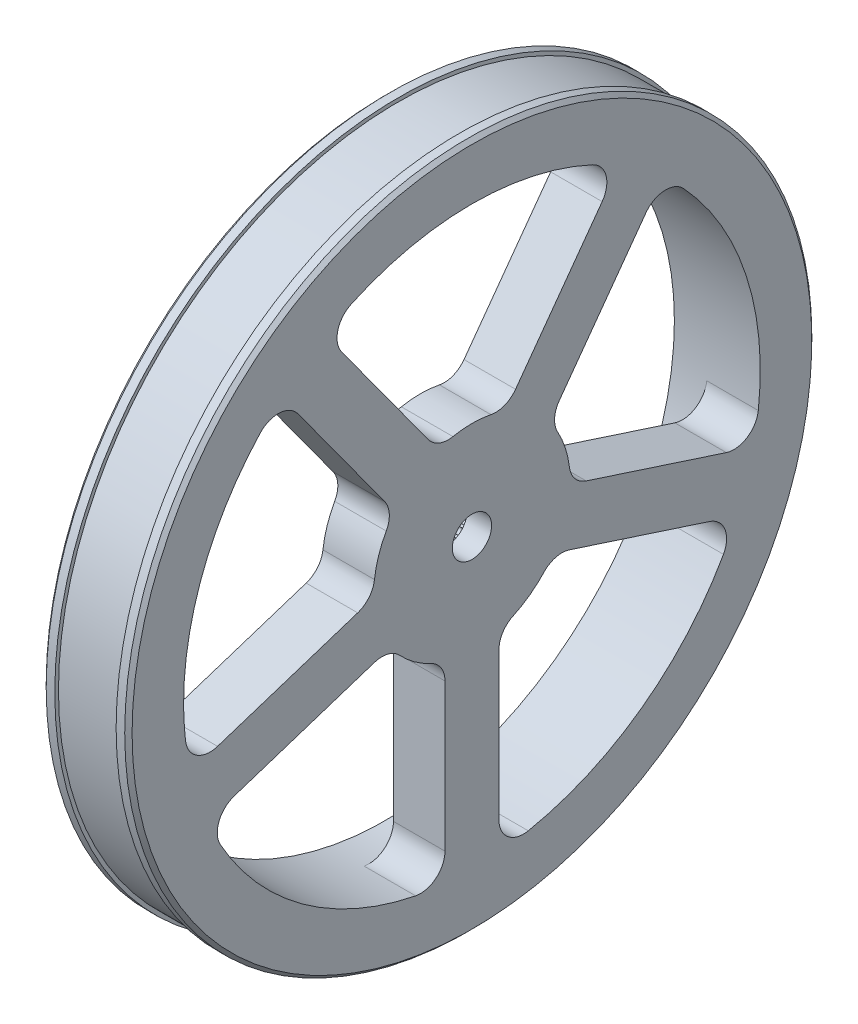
ISO-10303-21;
HEADER;
FILE_DESCRIPTION(('STEP AP214'),'2;1');
FILE_NAME('part.step','',(''),(''),'','','');
FILE_SCHEMA(('AUTOMOTIVE_DESIGN { 1 0 10303 214 1 1 1 1 }'));
ENDSEC;
DATA;
#1=APPLICATION_CONTEXT('core data for automotive mechanical design processes');
#2=APPLICATION_PROTOCOL_DEFINITION('international standard','automotive_design',2000,#1);
#3=PRODUCT_CONTEXT('',#1,'mechanical');
#4=PRODUCT('Part','Part','',(#3));
#5=PRODUCT_RELATED_PRODUCT_CATEGORY('part','',(#4));
#6=PRODUCT_DEFINITION_FORMATION('','',#4);
#7=PRODUCT_DEFINITION_CONTEXT('part definition',#1,'design');
#8=PRODUCT_DEFINITION('design','',#6,#7);
#9=PRODUCT_DEFINITION_SHAPE('','',#8);
#10=(LENGTH_UNIT() NAMED_UNIT(*) SI_UNIT(.MILLI.,.METRE.));
#11=(NAMED_UNIT(*) PLANE_ANGLE_UNIT() SI_UNIT($,.RADIAN.));
#12=(NAMED_UNIT(*) SI_UNIT($,.STERADIAN.) SOLID_ANGLE_UNIT());
#13=UNCERTAINTY_MEASURE_WITH_UNIT(LENGTH_MEASURE(1.E-05),#10,'distance_accuracy_value','');
#14=(GEOMETRIC_REPRESENTATION_CONTEXT(3) GLOBAL_UNCERTAINTY_ASSIGNED_CONTEXT((#13)) GLOBAL_UNIT_ASSIGNED_CONTEXT((#10,
#11,#12)) REPRESENTATION_CONTEXT('',''));
#15=CARTESIAN_POINT('',(0.,0.,0.));
#16=DIRECTION('',(0.,0.,1.));
#17=DIRECTION('',(1.,0.,0.));
#18=AXIS2_PLACEMENT_3D('',#15,#16,#17);
#19=CARTESIAN_POINT('',(0.,0.,0.));
#20=DIRECTION('',(-1.,0.,0.));
#21=DIRECTION('',(0.,0.,1.));
#22=AXIS2_PLACEMENT_3D('',#19,#20,#21);
#23=CYLINDRICAL_SURFACE('',#22,2.3);
#24=CARTESIAN_POINT('',(-3.12576650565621,0.,0.));
#25=DIRECTION('',(-1.,0.,0.));
#26=DIRECTION('',(0.,0.,1.));
#27=AXIS2_PLACEMENT_3D('',#24,#25,#26);
#28=CIRCLE('',#27,2.3);
#29=CARTESIAN_POINT('',(-3.12576650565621,2.02974498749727,1.08172791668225));
#30=VERTEX_POINT('',#29);
#31=CARTESIAN_POINT('',(-3.12576650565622,2.11125424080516,0.912472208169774));
#32=VERTEX_POINT('',#31);
#33=EDGE_CURVE('E562',#30,#32,#28,.T.);
#34=ORIENTED_EDGE('',*,*,#33,.F.);
#35=DIRECTION('',(-1.,0.,0.));
#36=VECTOR('',#35,1.);
#37=CARTESIAN_POINT('',(-4.22576650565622,2.02974498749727,1.08172791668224));
#38=LINE('',#37,#36);
#39=CARTESIAN_POINT('',(-5.32576650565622,2.02974498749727,1.08172791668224));
#40=VERTEX_POINT('',#39);
#41=EDGE_CURVE('E1006',#30,#40,#38,.T.);
#42=ORIENTED_EDGE('',*,*,#41,.T.);
#43=CARTESIAN_POINT('',(-5.32576650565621,0.,0.));
#44=DIRECTION('',(-1.,0.,0.));
#45=DIRECTION('',(0.,0.,1.));
#46=AXIS2_PLACEMENT_3D('',#43,#44,#45);
#47=CIRCLE('',#46,2.3);
#48=CARTESIAN_POINT('',(-5.32576650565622,2.11125424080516,0.912472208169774));
#49=VERTEX_POINT('',#48);
#50=EDGE_CURVE('E564',#40,#49,#47,.T.);
#51=ORIENTED_EDGE('',*,*,#50,.T.);
#52=DIRECTION('',(-1.,0.,0.));
#53=VECTOR('',#52,1.);
#54=CARTESIAN_POINT('',(-4.22576650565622,2.11125424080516,0.912472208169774));
#55=LINE('',#54,#53);
#56=EDGE_CURVE('E550',#49,#32,#55,.F.);
#57=ORIENTED_EDGE('',*,*,#56,.T.);
#58=EDGE_LOOP('',(#34,#42,#51,#57));
#59=FACE_BOUND('',#58,.T.);
#60=ADVANCED_FACE('F41',(#59),#23,.F.);
#61=CARTESIAN_POINT('',(-5.32576650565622,1.6207242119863,1.63194761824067));
#62=VERTEX_POINT('',#61);
#63=CARTESIAN_POINT('',(-5.32576650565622,1.74850123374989,1.49423674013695));
#64=VERTEX_POINT('',#63);
#65=EDGE_CURVE('E971',#62,#64,#47,.T.);
#66=ORIENTED_EDGE('',*,*,#65,.T.);
#67=DIRECTION('',(-1.,0.,0.));
#68=VECTOR('',#67,1.);
#69=CARTESIAN_POINT('',(-4.22576650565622,1.74850123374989,1.49423674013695));
#70=LINE('',#69,#68);
#71=CARTESIAN_POINT('',(-3.12576650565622,1.74850123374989,1.49423674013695));
#72=VERTEX_POINT('',#71);
#73=EDGE_CURVE('E973',#64,#72,#70,.F.);
#74=ORIENTED_EDGE('',*,*,#73,.T.);
#75=CARTESIAN_POINT('',(-3.12576650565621,1.6207242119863,1.63194761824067));
#76=VERTEX_POINT('',#75);
#77=EDGE_CURVE('E569',#76,#72,#28,.T.);
#78=ORIENTED_EDGE('',*,*,#77,.F.);
#79=DIRECTION('',(-1.,0.,0.));
#80=VECTOR('',#79,1.);
#81=CARTESIAN_POINT('',(-4.22576650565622,1.6207242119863,1.63194761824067));
#82=LINE('',#81,#80);
#83=EDGE_CURVE('E975',#76,#62,#82,.T.);
#84=ORIENTED_EDGE('',*,*,#83,.T.);
#85=EDGE_LOOP('',(#66,#74,#78,#84));
#86=FACE_BOUND('',#85,.T.);
#87=ADVANCED_FACE('F956',(#86),#23,.F.);
#88=CARTESIAN_POINT('',(-5.32576650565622,1.06769497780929,2.03716161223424));
#89=VERTEX_POINT('',#88);
#90=CARTESIAN_POINT('',(-5.32576650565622,1.23038621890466,1.94323178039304));
#91=VERTEX_POINT('',#90);
#92=EDGE_CURVE('E980',#89,#91,#47,.T.);
#93=ORIENTED_EDGE('',*,*,#92,.T.);
#94=DIRECTION('',(-1.,0.,0.));
#95=VECTOR('',#94,1.);
#96=CARTESIAN_POINT('',(-4.22576650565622,1.23038621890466,1.94323178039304));
#97=LINE('',#96,#95);
#98=CARTESIAN_POINT('',(-3.12576650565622,1.23038621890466,1.94323178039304));
#99=VERTEX_POINT('',#98);
#100=EDGE_CURVE('E1604',#91,#99,#97,.F.);
#101=ORIENTED_EDGE('',*,*,#100,.T.);
#102=CARTESIAN_POINT('',(-3.12576650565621,1.06769497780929,2.03716161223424));
#103=VERTEX_POINT('',#102);
#104=EDGE_CURVE('E574',#103,#99,#28,.T.);
#105=ORIENTED_EDGE('',*,*,#104,.F.);
#106=DIRECTION('',(-1.,0.,0.));
#107=VECTOR('',#106,1.);
#108=CARTESIAN_POINT('',(-4.22576650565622,1.06769497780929,2.03716161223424));
#109=LINE('',#108,#107);
#110=EDGE_CURVE('E1601',#103,#89,#109,.T.);
#111=ORIENTED_EDGE('',*,*,#110,.T.);
#112=EDGE_LOOP('',(#93,#101,#105,#111));
#113=FACE_BOUND('',#112,.T.);
#114=ADVANCED_FACE('F960',(#113),#23,.F.);
#115=CARTESIAN_POINT('',(-5.32576650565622,0.419796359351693,2.26136485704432));
#116=VERTEX_POINT('',#115);
#117=CARTESIAN_POINT('',(-5.32576650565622,0.602945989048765,2.21956214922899));
#118=VERTEX_POINT('',#117);
#119=EDGE_CURVE('E984',#116,#118,#47,.T.);
#120=ORIENTED_EDGE('',*,*,#119,.T.);
#121=DIRECTION('',(-1.,0.,0.));
#122=VECTOR('',#121,1.);
#123=CARTESIAN_POINT('',(-4.22576650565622,0.602945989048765,2.21956214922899));
#124=LINE('',#123,#122);
#125=CARTESIAN_POINT('',(-3.12576650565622,0.602945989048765,2.21956214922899));
#126=VERTEX_POINT('',#125);
#127=EDGE_CURVE('E1403',#118,#126,#124,.F.);
#128=ORIENTED_EDGE('',*,*,#127,.T.);
#129=CARTESIAN_POINT('',(-3.12576650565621,0.419796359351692,2.26136485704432));
#130=VERTEX_POINT('',#129);
#131=EDGE_CURVE('E1697',#130,#126,#28,.T.);
#132=ORIENTED_EDGE('',*,*,#131,.F.);
#133=DIRECTION('',(-1.,0.,0.));
#134=VECTOR('',#133,1.);
#135=CARTESIAN_POINT('',(-4.22576650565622,0.419796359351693,2.26136485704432));
#136=LINE('',#135,#134);
#137=EDGE_CURVE('E1406',#130,#116,#136,.T.);
#138=ORIENTED_EDGE('',*,*,#137,.T.);
#139=EDGE_LOOP('',(#120,#128,#132,#138));
#140=FACE_BOUND('',#139,.T.);
#141=ADVANCED_FACE('F965',(#140),#23,.F.);
#142=CARTESIAN_POINT('',(-5.32576650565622,-0.265403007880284,2.28463591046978));
#143=VERTEX_POINT('',#142);
#144=CARTESIAN_POINT('',(-5.32576650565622,-0.0780686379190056,2.29867468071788));
#145=VERTEX_POINT('',#144);
#146=EDGE_CURVE('E1385',#143,#145,#47,.T.);
#147=ORIENTED_EDGE('',*,*,#146,.T.);
#148=DIRECTION('',(-1.,0.,0.));
#149=VECTOR('',#148,1.);
#150=CARTESIAN_POINT('',(-4.22576650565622,-0.0780686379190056,2.29867468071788));
#151=LINE('',#150,#149);
#152=CARTESIAN_POINT('',(-3.12576650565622,-0.0780686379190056,2.29867468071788));
#153=VERTEX_POINT('',#152);
#154=EDGE_CURVE('E1594',#145,#153,#151,.F.);
#155=ORIENTED_EDGE('',*,*,#154,.T.);
#156=CARTESIAN_POINT('',(-3.12576650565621,-0.265403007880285,2.28463591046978));
#157=VERTEX_POINT('',#156);
#158=EDGE_CURVE('E1693',#157,#153,#28,.T.);
#159=ORIENTED_EDGE('',*,*,#158,.F.);
#160=DIRECTION('',(-1.,0.,0.));
#161=VECTOR('',#160,1.);
#162=CARTESIAN_POINT('',(-4.22576650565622,-0.265403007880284,2.28463591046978));
#163=LINE('',#162,#161);
#164=EDGE_CURVE('E1591',#157,#143,#163,.T.);
#165=ORIENTED_EDGE('',*,*,#164,.T.);
#166=EDGE_LOOP('',(#147,#155,#159,#165));
#167=FACE_BOUND('',#166,.T.);
#168=ADVANCED_FACE('F2280',(#167),#23,.F.);
#169=CARTESIAN_POINT('',(-5.32576650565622,-0.927020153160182,2.10490703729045));
#170=VERTEX_POINT('',#169);
#171=CARTESIAN_POINT('',(-5.32576650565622,-0.752146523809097,2.17353987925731));
#172=VERTEX_POINT('',#171);
#173=EDGE_CURVE('E1378',#170,#172,#47,.T.);
#174=ORIENTED_EDGE('',*,*,#173,.T.);
#175=DIRECTION('',(-1.,0.,0.));
#176=VECTOR('',#175,1.);
#177=CARTESIAN_POINT('',(-4.22576650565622,-0.752146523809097,2.17353987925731));
#178=LINE('',#177,#176);
#179=CARTESIAN_POINT('',(-3.12576650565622,-0.752146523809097,2.17353987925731));
#180=VERTEX_POINT('',#179);
#181=EDGE_CURVE('E1588',#172,#180,#178,.F.);
#182=ORIENTED_EDGE('',*,*,#181,.T.);
#183=CARTESIAN_POINT('',(-3.12576650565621,-0.927020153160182,2.10490703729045));
#184=VERTEX_POINT('',#183);
#185=EDGE_CURVE('E1689',#184,#180,#28,.T.);
#186=ORIENTED_EDGE('',*,*,#185,.F.);
#187=DIRECTION('',(-1.,0.,0.));
#188=VECTOR('',#187,1.);
#189=CARTESIAN_POINT('',(-4.22576650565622,-0.927020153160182,2.10490703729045));
#190=LINE('',#189,#188);
#191=EDGE_CURVE('E1585',#184,#170,#190,.T.);
#192=ORIENTED_EDGE('',*,*,#191,.T.);
#193=EDGE_LOOP('',(#174,#182,#186,#192));
#194=FACE_BOUND('',#193,.T.);
#195=ADVANCED_FACE('F2272',(#194),#23,.F.);
#196=CARTESIAN_POINT('',(-5.32576650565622,-1.50626748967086,1.73814793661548));
#197=VERTEX_POINT('',#196);
#198=CARTESIAN_POINT('',(-5.32576650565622,-1.3593928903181,1.85527652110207));
#199=VERTEX_POINT('',#198);
#200=EDGE_CURVE('E1371',#197,#199,#47,.T.);
#201=ORIENTED_EDGE('',*,*,#200,.T.);
#202=DIRECTION('',(-1.,0.,0.));
#203=VECTOR('',#202,1.);
#204=CARTESIAN_POINT('',(-4.22576650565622,-1.3593928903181,1.85527652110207));
#205=LINE('',#204,#203);
#206=CARTESIAN_POINT('',(-3.12576650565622,-1.3593928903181,1.85527652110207));
#207=VERTEX_POINT('',#206);
#208=EDGE_CURVE('E1582',#199,#207,#205,.F.);
#209=ORIENTED_EDGE('',*,*,#208,.T.);
#210=CARTESIAN_POINT('',(-3.12576650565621,-1.50626748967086,1.73814793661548));
#211=VERTEX_POINT('',#210);
#212=EDGE_CURVE('E1685',#211,#207,#28,.T.);
#213=ORIENTED_EDGE('',*,*,#212,.F.);
#214=DIRECTION('',(-1.,0.,0.));
#215=VECTOR('',#214,1.);
#216=CARTESIAN_POINT('',(-4.22576650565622,-1.50626748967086,1.73814793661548));
#217=LINE('',#216,#215);
#218=EDGE_CURVE('E1579',#211,#197,#217,.T.);
#219=ORIENTED_EDGE('',*,*,#218,.T.);
#220=EDGE_LOOP('',(#201,#209,#213,#219));
#221=FACE_BOUND('',#220,.T.);
#222=ADVANCED_FACE('F2264',(#221),#23,.F.);
#223=CARTESIAN_POINT('',(-5.32576650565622,-1.95167634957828,1.21694676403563));
#224=VERTEX_POINT('',#223);
#225=CARTESIAN_POINT('',(-5.32576650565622,-1.84585123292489,1.3721637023));
#226=VERTEX_POINT('',#225);
#227=EDGE_CURVE('E1364',#224,#226,#47,.T.);
#228=ORIENTED_EDGE('',*,*,#227,.T.);
#229=DIRECTION('',(-1.,0.,0.));
#230=VECTOR('',#229,1.);
#231=CARTESIAN_POINT('',(-4.22576650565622,-1.84585123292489,1.3721637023));
#232=LINE('',#231,#230);
#233=CARTESIAN_POINT('',(-3.12576650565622,-1.84585123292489,1.3721637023));
#234=VERTEX_POINT('',#233);
#235=EDGE_CURVE('E1576',#226,#234,#232,.F.);
#236=ORIENTED_EDGE('',*,*,#235,.T.);
#237=CARTESIAN_POINT('',(-3.12576650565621,-1.95167634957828,1.21694676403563));
#238=VERTEX_POINT('',#237);
#239=EDGE_CURVE('E1681',#238,#234,#28,.T.);
#240=ORIENTED_EDGE('',*,*,#239,.F.);
#241=DIRECTION('',(-1.,0.,0.));
#242=VECTOR('',#241,1.);
#243=CARTESIAN_POINT('',(-4.22576650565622,-1.95167634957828,1.21694676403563));
#244=LINE('',#243,#242);
#245=EDGE_CURVE('E1573',#238,#224,#244,.T.);
#246=ORIENTED_EDGE('',*,*,#245,.T.);
#247=EDGE_LOOP('',(#228,#236,#240,#246));
#248=FACE_BOUND('',#247,.T.);
#249=ADVANCED_FACE('F2256',(#248),#23,.F.);
#250=CARTESIAN_POINT('',(-5.32576650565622,-2.22367020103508,0.587614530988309));
#251=VERTEX_POINT('',#250);
#252=CARTESIAN_POINT('',(-5.32576650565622,-2.1682975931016,0.767128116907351));
#253=VERTEX_POINT('',#252);
#254=EDGE_CURVE('E1357',#251,#253,#47,.T.);
#255=ORIENTED_EDGE('',*,*,#254,.T.);
#256=DIRECTION('',(-1.,0.,0.));
#257=VECTOR('',#256,1.);
#258=CARTESIAN_POINT('',(-4.22576650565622,-2.1682975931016,0.767128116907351));
#259=LINE('',#258,#257);
#260=CARTESIAN_POINT('',(-3.12576650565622,-2.1682975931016,0.767128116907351));
#261=VERTEX_POINT('',#260);
#262=EDGE_CURVE('E1570',#253,#261,#259,.F.);
#263=ORIENTED_EDGE('',*,*,#262,.T.);
#264=CARTESIAN_POINT('',(-3.12576650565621,-2.22367020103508,0.587614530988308));
#265=VERTEX_POINT('',#264);
#266=EDGE_CURVE('E1677',#265,#261,#28,.T.);
#267=ORIENTED_EDGE('',*,*,#266,.F.);
#268=DIRECTION('',(-1.,0.,0.));
#269=VECTOR('',#268,1.);
#270=CARTESIAN_POINT('',(-4.22576650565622,-2.22367020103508,0.587614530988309));
#271=LINE('',#270,#269);
#272=EDGE_CURVE('E1567',#265,#251,#271,.T.);
#273=ORIENTED_EDGE('',*,*,#272,.T.);
#274=EDGE_LOOP('',(#255,#263,#267,#273));
#275=FACE_BOUND('',#274,.T.);
#276=ADVANCED_FACE('F2248',(#275),#23,.F.);
#277=CARTESIAN_POINT('',(-5.32576650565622,-2.29808119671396,-0.0939298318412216));
#278=VERTEX_POINT('',#277);
#279=CARTESIAN_POINT('',(-5.32576650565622,-2.29808119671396,0.0939298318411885));
#280=VERTEX_POINT('',#279);
#281=EDGE_CURVE('E1350',#278,#280,#47,.T.);
#282=ORIENTED_EDGE('',*,*,#281,.T.);
#283=DIRECTION('',(-1.,0.,0.));
#284=VECTOR('',#283,1.);
#285=CARTESIAN_POINT('',(-4.22576650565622,-2.29808119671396,0.0939298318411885));
#286=LINE('',#285,#284);
#287=CARTESIAN_POINT('',(-3.12576650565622,-2.29808119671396,0.0939298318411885));
#288=VERTEX_POINT('',#287);
#289=EDGE_CURVE('E1564',#280,#288,#286,.F.);
#290=ORIENTED_EDGE('',*,*,#289,.T.);
#291=CARTESIAN_POINT('',(-3.12576650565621,-2.29808119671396,-0.0939298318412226));
#292=VERTEX_POINT('',#291);
#293=EDGE_CURVE('E1673',#292,#288,#28,.T.);
#294=ORIENTED_EDGE('',*,*,#293,.F.);
#295=DIRECTION('',(-1.,0.,0.));
#296=VECTOR('',#295,1.);
#297=CARTESIAN_POINT('',(-4.22576650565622,-2.29808119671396,-0.0939298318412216));
#298=LINE('',#297,#296);
#299=EDGE_CURVE('E1561',#292,#278,#298,.T.);
#300=ORIENTED_EDGE('',*,*,#299,.T.);
#301=EDGE_LOOP('',(#282,#290,#294,#300));
#302=FACE_BOUND('',#301,.T.);
#303=ADVANCED_FACE('F2240',(#302),#23,.F.);
#304=CARTESIAN_POINT('',(-5.32576650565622,-2.16829759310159,-0.767128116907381));
#305=VERTEX_POINT('',#304);
#306=CARTESIAN_POINT('',(-5.32576650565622,-2.22367020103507,-0.587614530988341));
#307=VERTEX_POINT('',#306);
#308=EDGE_CURVE('E1343',#305,#307,#47,.T.);
#309=ORIENTED_EDGE('',*,*,#308,.T.);
#310=DIRECTION('',(-1.,0.,0.));
#311=VECTOR('',#310,1.);
#312=CARTESIAN_POINT('',(-4.22576650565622,-2.22367020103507,-0.587614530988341));
#313=LINE('',#312,#311);
#314=CARTESIAN_POINT('',(-3.12576650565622,-2.22367020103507,-0.587614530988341));
#315=VERTEX_POINT('',#314);
#316=EDGE_CURVE('E1558',#307,#315,#313,.F.);
#317=ORIENTED_EDGE('',*,*,#316,.T.);
#318=CARTESIAN_POINT('',(-3.12576650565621,-2.16829759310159,-0.767128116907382));
#319=VERTEX_POINT('',#318);
#320=EDGE_CURVE('E1669',#319,#315,#28,.T.);
#321=ORIENTED_EDGE('',*,*,#320,.F.);
#322=DIRECTION('',(-1.,0.,0.));
#323=VECTOR('',#322,1.);
#324=CARTESIAN_POINT('',(-4.22576650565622,-2.16829759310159,-0.767128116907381));
#325=LINE('',#324,#323);
#326=EDGE_CURVE('E1555',#319,#305,#325,.T.);
#327=ORIENTED_EDGE('',*,*,#326,.T.);
#328=EDGE_LOOP('',(#309,#317,#321,#327));
#329=FACE_BOUND('',#328,.T.);
#330=ADVANCED_FACE('F2232',(#329),#23,.F.);
#331=CARTESIAN_POINT('',(-5.32576650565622,-1.84585123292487,-1.37216370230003));
#332=VERTEX_POINT('',#331);
#333=CARTESIAN_POINT('',(-5.32576650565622,-1.95167634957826,-1.21694676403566));
#334=VERTEX_POINT('',#333);
#335=EDGE_CURVE('E1336',#332,#334,#47,.T.);
#336=ORIENTED_EDGE('',*,*,#335,.T.);
#337=DIRECTION('',(-1.,0.,0.));
#338=VECTOR('',#337,1.);
#339=CARTESIAN_POINT('',(-4.22576650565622,-1.95167634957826,-1.21694676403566));
#340=LINE('',#339,#338);
#341=CARTESIAN_POINT('',(-3.12576650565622,-1.95167634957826,-1.21694676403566));
#342=VERTEX_POINT('',#341);
#343=EDGE_CURVE('E1552',#334,#342,#340,.F.);
#344=ORIENTED_EDGE('',*,*,#343,.T.);
#345=CARTESIAN_POINT('',(-3.12576650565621,-1.84585123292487,-1.37216370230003));
#346=VERTEX_POINT('',#345);
#347=EDGE_CURVE('E1665',#346,#342,#28,.T.);
#348=ORIENTED_EDGE('',*,*,#347,.F.);
#349=DIRECTION('',(-1.,0.,0.));
#350=VECTOR('',#349,1.);
#351=CARTESIAN_POINT('',(-4.22576650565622,-1.84585123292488,-1.37216370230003));
#352=LINE('',#351,#350);
#353=EDGE_CURVE('E1549',#346,#332,#352,.T.);
#354=ORIENTED_EDGE('',*,*,#353,.T.);
#355=EDGE_LOOP('',(#336,#344,#348,#354));
#356=FACE_BOUND('',#355,.T.);
#357=ADVANCED_FACE('F2224',(#356),#23,.F.);
#358=CARTESIAN_POINT('',(-5.32576650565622,-1.35939289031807,-1.85527652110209));
#359=VERTEX_POINT('',#358);
#360=CARTESIAN_POINT('',(-5.32576650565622,-1.50626748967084,-1.7381479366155));
#361=VERTEX_POINT('',#360);
#362=EDGE_CURVE('E1329',#359,#361,#47,.T.);
#363=ORIENTED_EDGE('',*,*,#362,.T.);
#364=DIRECTION('',(-1.,0.,0.));
#365=VECTOR('',#364,1.);
#366=CARTESIAN_POINT('',(-4.22576650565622,-1.50626748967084,-1.7381479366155));
#367=LINE('',#366,#365);
#368=CARTESIAN_POINT('',(-3.12576650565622,-1.50626748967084,-1.7381479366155));
#369=VERTEX_POINT('',#368);
#370=EDGE_CURVE('E1546',#361,#369,#367,.F.);
#371=ORIENTED_EDGE('',*,*,#370,.T.);
#372=CARTESIAN_POINT('',(-3.12576650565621,-1.35939289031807,-1.85527652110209));
#373=VERTEX_POINT('',#372);
#374=EDGE_CURVE('E1661',#373,#369,#28,.T.);
#375=ORIENTED_EDGE('',*,*,#374,.F.);
#376=DIRECTION('',(-1.,0.,0.));
#377=VECTOR('',#376,1.);
#378=CARTESIAN_POINT('',(-4.22576650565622,-1.35939289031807,-1.85527652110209));
#379=LINE('',#378,#377);
#380=EDGE_CURVE('E1543',#373,#359,#379,.T.);
#381=ORIENTED_EDGE('',*,*,#380,.T.);
#382=EDGE_LOOP('',(#363,#371,#375,#381));
#383=FACE_BOUND('',#382,.T.);
#384=ADVANCED_FACE('F2216',(#383),#23,.F.);
#385=CARTESIAN_POINT('',(-5.32576650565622,-0.752146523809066,-2.17353987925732));
#386=VERTEX_POINT('',#385);
#387=CARTESIAN_POINT('',(-5.32576650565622,-0.927020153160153,-2.10490703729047));
#388=VERTEX_POINT('',#387);
#389=EDGE_CURVE('E1322',#386,#388,#47,.T.);
#390=ORIENTED_EDGE('',*,*,#389,.T.);
#391=DIRECTION('',(-1.,0.,0.));
#392=VECTOR('',#391,1.);
#393=CARTESIAN_POINT('',(-4.22576650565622,-0.927020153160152,-2.10490703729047));
#394=LINE('',#393,#392);
#395=CARTESIAN_POINT('',(-3.12576650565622,-0.927020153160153,-2.10490703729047));
#396=VERTEX_POINT('',#395);
#397=EDGE_CURVE('E1540',#388,#396,#394,.F.);
#398=ORIENTED_EDGE('',*,*,#397,.T.);
#399=CARTESIAN_POINT('',(-3.12576650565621,-0.752146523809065,-2.17353987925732));
#400=VERTEX_POINT('',#399);
#401=EDGE_CURVE('E1657',#400,#396,#28,.T.);
#402=ORIENTED_EDGE('',*,*,#401,.F.);
#403=DIRECTION('',(-1.,0.,0.));
#404=VECTOR('',#403,1.);
#405=CARTESIAN_POINT('',(-4.22576650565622,-0.752146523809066,-2.17353987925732));
#406=LINE('',#405,#404);
#407=EDGE_CURVE('E1537',#400,#386,#406,.T.);
#408=ORIENTED_EDGE('',*,*,#407,.T.);
#409=EDGE_LOOP('',(#390,#398,#402,#408));
#410=FACE_BOUND('',#409,.T.);
#411=ADVANCED_FACE('F2208',(#410),#23,.F.);
#412=CARTESIAN_POINT('',(-5.32576650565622,-0.078068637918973,-2.29867468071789));
#413=VERTEX_POINT('',#412);
#414=CARTESIAN_POINT('',(-5.32576650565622,-0.265403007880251,-2.28463591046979));
#415=VERTEX_POINT('',#414);
#416=EDGE_CURVE('E1315',#413,#415,#47,.T.);
#417=ORIENTED_EDGE('',*,*,#416,.T.);
#418=DIRECTION('',(-1.,0.,0.));
#419=VECTOR('',#418,1.);
#420=CARTESIAN_POINT('',(-4.22576650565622,-0.265403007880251,-2.28463591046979));
#421=LINE('',#420,#419);
#422=CARTESIAN_POINT('',(-3.12576650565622,-0.265403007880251,-2.28463591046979));
#423=VERTEX_POINT('',#422);
#424=EDGE_CURVE('E1534',#415,#423,#421,.F.);
#425=ORIENTED_EDGE('',*,*,#424,.T.);
#426=CARTESIAN_POINT('',(-3.12576650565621,-0.078068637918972,-2.29867468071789));
#427=VERTEX_POINT('',#426);
#428=EDGE_CURVE('E1653',#427,#423,#28,.T.);
#429=ORIENTED_EDGE('',*,*,#428,.F.);
#430=DIRECTION('',(-1.,0.,0.));
#431=VECTOR('',#430,1.);
#432=CARTESIAN_POINT('',(-4.22576650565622,-0.078068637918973,-2.29867468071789));
#433=LINE('',#432,#431);
#434=EDGE_CURVE('E1531',#427,#413,#433,.T.);
#435=ORIENTED_EDGE('',*,*,#434,.T.);
#436=EDGE_LOOP('',(#417,#425,#429,#435));
#437=FACE_BOUND('',#436,.T.);
#438=ADVANCED_FACE('F2200',(#437),#23,.F.);
#439=CARTESIAN_POINT('',(-5.32576650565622,0.602945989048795,-2.21956214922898));
#440=VERTEX_POINT('',#439);
#441=CARTESIAN_POINT('',(-5.32576650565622,0.419796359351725,-2.26136485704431));
#442=VERTEX_POINT('',#441);
#443=EDGE_CURVE('E1308',#440,#442,#47,.T.);
#444=ORIENTED_EDGE('',*,*,#443,.T.);
#445=DIRECTION('',(-1.,0.,0.));
#446=VECTOR('',#445,1.);
#447=CARTESIAN_POINT('',(-4.22576650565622,0.419796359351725,-2.26136485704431));
#448=LINE('',#447,#446);
#449=CARTESIAN_POINT('',(-3.12576650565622,0.419796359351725,-2.26136485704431));
#450=VERTEX_POINT('',#449);
#451=EDGE_CURVE('E1528',#442,#450,#448,.F.);
#452=ORIENTED_EDGE('',*,*,#451,.T.);
#453=CARTESIAN_POINT('',(-3.12576650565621,0.602945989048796,-2.21956214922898));
#454=VERTEX_POINT('',#453);
#455=EDGE_CURVE('E1649',#454,#450,#28,.T.);
#456=ORIENTED_EDGE('',*,*,#455,.F.);
#457=DIRECTION('',(-1.,0.,0.));
#458=VECTOR('',#457,1.);
#459=CARTESIAN_POINT('',(-4.22576650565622,0.602945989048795,-2.21956214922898));
#460=LINE('',#459,#458);
#461=EDGE_CURVE('E1525',#454,#440,#460,.T.);
#462=ORIENTED_EDGE('',*,*,#461,.T.);
#463=EDGE_LOOP('',(#444,#452,#456,#462));
#464=FACE_BOUND('',#463,.T.);
#465=ADVANCED_FACE('F2192',(#464),#23,.F.);
#466=CARTESIAN_POINT('',(-5.32576650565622,1.23038621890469,-1.94323178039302));
#467=VERTEX_POINT('',#466);
#468=CARTESIAN_POINT('',(-5.32576650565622,1.06769497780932,-2.03716161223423));
#469=VERTEX_POINT('',#468);
#470=EDGE_CURVE('E1302',#467,#469,#47,.T.);
#471=ORIENTED_EDGE('',*,*,#470,.T.);
#472=DIRECTION('',(-1.,0.,0.));
#473=VECTOR('',#472,1.);
#474=CARTESIAN_POINT('',(-4.22576650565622,1.06769497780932,-2.03716161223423));
#475=LINE('',#474,#473);
#476=CARTESIAN_POINT('',(-3.12576650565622,1.06769497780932,-2.03716161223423));
#477=VERTEX_POINT('',#476);
#478=EDGE_CURVE('E1522',#469,#477,#475,.F.);
#479=ORIENTED_EDGE('',*,*,#478,.T.);
#480=CARTESIAN_POINT('',(-3.12576650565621,1.23038621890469,-1.94323178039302));
#481=VERTEX_POINT('',#480);
#482=EDGE_CURVE('E1642',#481,#477,#28,.T.);
#483=ORIENTED_EDGE('',*,*,#482,.F.);
#484=DIRECTION('',(-1.,0.,0.));
#485=VECTOR('',#484,1.);
#486=CARTESIAN_POINT('',(-4.22576650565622,1.23038621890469,-1.94323178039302));
#487=LINE('',#486,#485);
#488=EDGE_CURVE('E1519',#481,#467,#487,.T.);
#489=ORIENTED_EDGE('',*,*,#488,.T.);
#490=EDGE_LOOP('',(#471,#479,#483,#489));
#491=FACE_BOUND('',#490,.T.);
#492=ADVANCED_FACE('F1286',(#491),#23,.F.);
#493=CARTESIAN_POINT('',(-5.32576650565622,1.74850123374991,-1.49423674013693));
#494=VERTEX_POINT('',#493);
#495=CARTESIAN_POINT('',(-5.32576650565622,1.62072421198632,-1.63194761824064));
#496=VERTEX_POINT('',#495);
#497=EDGE_CURVE('E1299',#494,#496,#47,.T.);
#498=ORIENTED_EDGE('',*,*,#497,.T.);
#499=DIRECTION('',(-1.,0.,0.));
#500=VECTOR('',#499,1.);
#501=CARTESIAN_POINT('',(-4.22576650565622,1.62072421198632,-1.63194761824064));
#502=LINE('',#501,#500);
#503=CARTESIAN_POINT('',(-3.12576650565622,1.62072421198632,-1.63194761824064));
#504=VERTEX_POINT('',#503);
#505=EDGE_CURVE('E1516',#496,#504,#502,.F.);
#506=ORIENTED_EDGE('',*,*,#505,.T.);
#507=CARTESIAN_POINT('',(-3.12576650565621,1.74850123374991,-1.49423674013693));
#508=VERTEX_POINT('',#507);
#509=EDGE_CURVE('E1644',#508,#504,#28,.T.);
#510=ORIENTED_EDGE('',*,*,#509,.F.);
#511=DIRECTION('',(-1.,0.,0.));
#512=VECTOR('',#511,1.);
#513=CARTESIAN_POINT('',(-4.22576650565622,1.74850123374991,-1.49423674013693));
#514=LINE('',#513,#512);
#515=EDGE_CURVE('E1513',#508,#494,#514,.T.);
#516=ORIENTED_EDGE('',*,*,#515,.T.);
#517=EDGE_LOOP('',(#498,#506,#510,#516));
#518=FACE_BOUND('',#517,.T.);
#519=ADVANCED_FACE('F1281',(#518),#23,.F.);
#520=CARTESIAN_POINT('',(-5.32576650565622,2.11125424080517,-0.912472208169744));
#521=VERTEX_POINT('',#520);
#522=CARTESIAN_POINT('',(-5.32576650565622,2.02974498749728,-1.08172791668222));
#523=VERTEX_POINT('',#522);
#524=EDGE_CURVE('E589',#521,#523,#47,.T.);
#525=ORIENTED_EDGE('',*,*,#524,.T.);
#526=DIRECTION('',(-1.,0.,0.));
#527=VECTOR('',#526,1.);
#528=CARTESIAN_POINT('',(-4.22576650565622,2.02974498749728,-1.08172791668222));
#529=LINE('',#528,#527);
#530=CARTESIAN_POINT('',(-3.12576650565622,2.02974498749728,-1.08172791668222));
#531=VERTEX_POINT('',#530);
#532=EDGE_CURVE('E1293',#523,#531,#529,.F.);
#533=ORIENTED_EDGE('',*,*,#532,.T.);
#534=CARTESIAN_POINT('',(-3.12576650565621,2.11125424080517,-0.912472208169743));
#535=VERTEX_POINT('',#534);
#536=EDGE_CURVE('E582',#535,#531,#28,.T.);
#537=ORIENTED_EDGE('',*,*,#536,.F.);
#538=DIRECTION('',(-1.,0.,0.));
#539=VECTOR('',#538,1.);
#540=CARTESIAN_POINT('',(-4.22576650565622,2.11125424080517,-0.912472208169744));
#541=LINE('',#540,#539);
#542=EDGE_CURVE('E1296',#535,#521,#541,.T.);
#543=ORIENTED_EDGE('',*,*,#542,.T.);
#544=EDGE_LOOP('',(#525,#533,#537,#543));
#545=FACE_BOUND('',#544,.T.);
#546=ADVANCED_FACE('F1277',(#545),#23,.F.);
#547=CARTESIAN_POINT('',(-3.12576650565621,2.25841401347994,0.435391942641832));
#548=VERTEX_POINT('',#547);
#549=CARTESIAN_POINT('',(-3.12576650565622,2.28641304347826,0.249630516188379));
#550=VERTEX_POINT('',#549);
#551=EDGE_CURVE('E570',#548,#550,#28,.T.);
#552=ORIENTED_EDGE('',*,*,#551,.F.);
#553=DIRECTION('',(-1.,0.,0.));
#554=VECTOR('',#553,1.);
#555=CARTESIAN_POINT('',(-4.22576650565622,2.25841401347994,0.435391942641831));
#556=LINE('',#555,#554);
#557=CARTESIAN_POINT('',(-5.32576650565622,2.25841401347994,0.435391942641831));
#558=VERTEX_POINT('',#557);
#559=EDGE_CURVE('E553',#548,#558,#556,.T.);
#560=ORIENTED_EDGE('',*,*,#559,.T.);
#561=CARTESIAN_POINT('',(-5.32576650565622,2.28641304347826,0.249630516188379));
#562=VERTEX_POINT('',#561);
#563=EDGE_CURVE('E581',#558,#562,#47,.T.);
#564=ORIENTED_EDGE('',*,*,#563,.T.);
#565=DIRECTION('',(-1.,0.,0.));
#566=VECTOR('',#565,1.);
#567=CARTESIAN_POINT('',(-4.22576650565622,2.28641304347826,0.249630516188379));
#568=LINE('',#567,#566);
#569=EDGE_CURVE('E990',#562,#550,#568,.F.);
#570=ORIENTED_EDGE('',*,*,#569,.T.);
#571=EDGE_LOOP('',(#552,#560,#564,#570));
#572=FACE_BOUND('',#571,.T.);
#573=ADVANCED_FACE('F954',(#572),#23,.F.);
#574=CARTESIAN_POINT('',(-5.32576650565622,23.5,0.));
#575=DIRECTION('',(1.,0.,0.));
#576=DIRECTION('',(0.,0.,-1.));
#577=AXIS2_PLACEMENT_3D('',#574,#575,#576);
#578=PLANE('',#577);
#579=ORIENTED_EDGE('',*,*,#50,.F.);
#580=CARTESIAN_POINT('',(-5.32576650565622,1.90034918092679,1.29563613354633));
#581=DIRECTION('',(-1.,0.,0.));
#582=DIRECTION('',(0.,-0.563320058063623,0.826238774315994));
#583=AXIS2_PLACEMENT_3D('',#580,#581,#582);
#584=CIRCLE('',#583,0.25);
#585=EDGE_CURVE('E1613',#64,#40,#584,.T.);
#586=ORIENTED_EDGE('',*,*,#585,.F.);
#587=ORIENTED_EDGE('',*,*,#65,.F.);
#588=CARTESIAN_POINT('',(-5.32576650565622,1.43402654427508,1.79821240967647));
#589=DIRECTION('',(-1.,0.,0.));
#590=DIRECTION('',(0.,-0.781831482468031,0.623489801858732));
#591=AXIS2_PLACEMENT_3D('',#588,#589,#590);
#592=CIRCLE('',#591,0.25);
#593=EDGE_CURVE('E1421',#91,#62,#592,.T.);
#594=ORIENTED_EDGE('',*,*,#593,.F.);
#595=ORIENTED_EDGE('',*,*,#92,.F.);
#596=CARTESIAN_POINT('',(-5.32576650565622,0.840284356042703,2.14100962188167));
#597=DIRECTION('',(-1.,0.,0.));
#598=DIRECTION('',(0.,-0.930873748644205,0.365341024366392));
#599=AXIS2_PLACEMENT_3D('',#596,#597,#598);
#600=CIRCLE('',#599,0.25);
#601=EDGE_CURVE('E1411',#118,#89,#600,.T.);
#602=ORIENTED_EDGE('',*,*,#601,.F.);
#603=ORIENTED_EDGE('',*,*,#119,.F.);
#604=CARTESIAN_POINT('',(-5.32576650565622,0.171879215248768,2.29356873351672));
#605=DIRECTION('',(-1.,0.,0.));
#606=DIRECTION('',(0.,-0.997203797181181,0.0747300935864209));
#607=AXIS2_PLACEMENT_3D('',#604,#605,#606);
#608=CIRCLE('',#607,0.25);
#609=EDGE_CURVE('E1409',#145,#116,#608,.T.);
#610=ORIENTED_EDGE('',*,*,#609,.F.);
#611=ORIENTED_EDGE('',*,*,#146,.F.);
#612=CARTESIAN_POINT('',(-5.32576650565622,-0.511798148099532,2.24233419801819));
#613=DIRECTION('',(-1.,0.,0.));
#614=DIRECTION('',(0.,-0.974927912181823,-0.222520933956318));
#615=AXIS2_PLACEMENT_3D('',#612,#613,#614);
#616=CIRCLE('',#615,0.25);
#617=EDGE_CURVE('E1431',#172,#143,#616,.T.);
#618=ORIENTED_EDGE('',*,*,#617,.F.);
#619=ORIENTED_EDGE('',*,*,#173,.F.);
#620=CARTESIAN_POINT('',(-5.32576650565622,-1.15000000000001,1.9918584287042));
#621=DIRECTION('',(-1.,0.,0.));
#622=DIRECTION('',(0.,-0.866025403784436,-0.500000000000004));
#623=AXIS2_PLACEMENT_3D('',#620,#621,#622);
#624=CIRCLE('',#623,0.25);
#625=EDGE_CURVE('E1437',#199,#170,#624,.T.);
#626=ORIENTED_EDGE('',*,*,#625,.F.);
#627=ORIENTED_EDGE('',*,*,#200,.F.);
#628=CARTESIAN_POINT('',(-5.32576650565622,-1.68601930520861,1.56439729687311));
#629=DIRECTION('',(-1.,0.,0.));
#630=DIRECTION('',(0.,-0.680172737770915,-0.73305187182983));
#631=AXIS2_PLACEMENT_3D('',#628,#629,#630);
#632=CIRCLE('',#631,0.25);
#633=EDGE_CURVE('E1443',#226,#197,#632,.T.);
#634=ORIENTED_EDGE('',*,*,#633,.F.);
#635=ORIENTED_EDGE('',*,*,#227,.F.);
#636=CARTESIAN_POINT('',(-5.32576650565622,-2.07222839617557,0.997932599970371));
#637=DIRECTION('',(-1.,0.,0.));
#638=DIRECTION('',(0.,-0.433883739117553,-0.900968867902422));
#639=AXIS2_PLACEMENT_3D('',#636,#637,#638);
#640=CIRCLE('',#639,0.25);
#641=EDGE_CURVE('E1449',#253,#224,#640,.T.);
#642=ORIENTED_EDGE('',*,*,#641,.F.);
#643=ORIENTED_EDGE('',*,*,#254,.F.);
#644=CARTESIAN_POINT('',(-5.32576650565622,-2.2743109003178,0.342797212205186));
#645=DIRECTION('',(-1.,0.,0.));
#646=DIRECTION('',(0.,-0.149042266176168,-0.98883082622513));
#647=AXIS2_PLACEMENT_3D('',#644,#645,#646);
#648=CIRCLE('',#647,0.25);
#649=EDGE_CURVE('E1455',#280,#251,#648,.T.);
#650=ORIENTED_EDGE('',*,*,#649,.F.);
#651=ORIENTED_EDGE('',*,*,#281,.F.);
#652=CARTESIAN_POINT('',(-5.32576650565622,-2.27431090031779,-0.342797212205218));
#653=DIRECTION('',(-1.,0.,0.));
#654=DIRECTION('',(0.,0.149042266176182,-0.988830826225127));
#655=AXIS2_PLACEMENT_3D('',#652,#653,#654);
#656=CIRCLE('',#655,0.25);
#657=EDGE_CURVE('E1461',#307,#278,#656,.T.);
#658=ORIENTED_EDGE('',*,*,#657,.F.);
#659=ORIENTED_EDGE('',*,*,#308,.F.);
#660=CARTESIAN_POINT('',(-5.32576650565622,-2.07222839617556,-0.9979325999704));
#661=DIRECTION('',(-1.,0.,0.));
#662=DIRECTION('',(0.,0.433883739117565,-0.900968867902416));
#663=AXIS2_PLACEMENT_3D('',#660,#661,#662);
#664=CIRCLE('',#663,0.25);
#665=EDGE_CURVE('E1467',#334,#305,#664,.T.);
#666=ORIENTED_EDGE('',*,*,#665,.F.);
#667=ORIENTED_EDGE('',*,*,#335,.F.);
#668=CARTESIAN_POINT('',(-5.32576650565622,-1.68601930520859,-1.56439729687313));
#669=DIRECTION('',(-1.,0.,0.));
#670=DIRECTION('',(0.,0.680172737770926,-0.73305187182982));
#671=AXIS2_PLACEMENT_3D('',#668,#669,#670);
#672=CIRCLE('',#671,0.25);
#673=EDGE_CURVE('E1473',#361,#332,#672,.T.);
#674=ORIENTED_EDGE('',*,*,#673,.F.);
#675=ORIENTED_EDGE('',*,*,#362,.F.);
#676=CARTESIAN_POINT('',(-5.32576650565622,-1.14999999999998,-1.99185842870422));
#677=DIRECTION('',(-1.,0.,0.));
#678=DIRECTION('',(0.,0.866025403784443,-0.499999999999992));
#679=AXIS2_PLACEMENT_3D('',#676,#677,#678);
#680=CIRCLE('',#679,0.25);
#681=EDGE_CURVE('E1479',#388,#359,#680,.T.);
#682=ORIENTED_EDGE('',*,*,#681,.F.);
#683=ORIENTED_EDGE('',*,*,#389,.F.);
#684=CARTESIAN_POINT('',(-5.32576650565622,-0.5117981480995,-2.2423341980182));
#685=DIRECTION('',(-1.,0.,0.));
#686=DIRECTION('',(0.,0.974927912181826,-0.222520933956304));
#687=AXIS2_PLACEMENT_3D('',#684,#685,#686);
#688=CIRCLE('',#687,0.25);
#689=EDGE_CURVE('E1485',#415,#386,#688,.T.);
#690=ORIENTED_EDGE('',*,*,#689,.F.);
#691=ORIENTED_EDGE('',*,*,#416,.F.);
#692=CARTESIAN_POINT('',(-5.32576650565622,0.171879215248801,-2.29356873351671));
#693=DIRECTION('',(-1.,0.,0.));
#694=DIRECTION('',(0.,0.997203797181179,0.074730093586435));
#695=AXIS2_PLACEMENT_3D('',#692,#693,#694);
#696=CIRCLE('',#695,0.25);
#697=EDGE_CURVE('E1491',#442,#413,#696,.T.);
#698=ORIENTED_EDGE('',*,*,#697,.F.);
#699=ORIENTED_EDGE('',*,*,#443,.F.);
#700=CARTESIAN_POINT('',(-5.32576650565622,0.840284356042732,-2.14100962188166));
#701=DIRECTION('',(-1.,0.,0.));
#702=DIRECTION('',(0.,0.9308737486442,0.365341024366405));
#703=AXIS2_PLACEMENT_3D('',#700,#701,#702);
#704=CIRCLE('',#703,0.25);
#705=EDGE_CURVE('E1497',#469,#440,#704,.T.);
#706=ORIENTED_EDGE('',*,*,#705,.F.);
#707=ORIENTED_EDGE('',*,*,#470,.F.);
#708=CARTESIAN_POINT('',(-5.32576650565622,1.43402654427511,-1.79821240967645));
#709=DIRECTION('',(-1.,0.,0.));
#710=DIRECTION('',(0.,0.781831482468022,0.623489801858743));
#711=AXIS2_PLACEMENT_3D('',#708,#709,#710);
#712=CIRCLE('',#711,0.25);
#713=EDGE_CURVE('E1634',#496,#467,#712,.T.);
#714=ORIENTED_EDGE('',*,*,#713,.F.);
#715=ORIENTED_EDGE('',*,*,#497,.F.);
#716=CARTESIAN_POINT('',(-5.32576650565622,1.9003491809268,-1.29563613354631));
#717=DIRECTION('',(-1.,0.,0.));
#718=DIRECTION('',(0.,0.563320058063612,0.826238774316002));
#719=AXIS2_PLACEMENT_3D('',#716,#717,#718);
#720=CIRCLE('',#719,0.25);
#721=EDGE_CURVE('E1628',#523,#494,#720,.T.);
#722=ORIENTED_EDGE('',*,*,#721,.F.);
#723=ORIENTED_EDGE('',*,*,#524,.F.);
#724=CARTESIAN_POINT('',(-5.32576650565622,2.19781745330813,-0.67793690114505));
#725=DIRECTION('',(-1.,0.,0.));
#726=DIRECTION('',(0.,0.294755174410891,0.955572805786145));
#727=AXIS2_PLACEMENT_3D('',#724,#725,#726);
#728=CIRCLE('',#727,0.25);
#729=CARTESIAN_POINT('',(-5.32576650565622,2.25841401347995,-0.435391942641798));
#730=VERTEX_POINT('',#729);
#731=EDGE_CURVE('E1622',#730,#521,#728,.T.);
#732=ORIENTED_EDGE('',*,*,#731,.F.);
#733=CARTESIAN_POINT('',(-5.32576650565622,2.28641304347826,-0.249630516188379));
#734=VERTEX_POINT('',#733);
#735=EDGE_CURVE('E584',#734,#730,#47,.T.);
#736=ORIENTED_EDGE('',*,*,#735,.F.);
#737=CARTESIAN_POINT('',(-5.32576650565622,2.3,0.));
#738=DIRECTION('',(-1.,0.,0.));
#739=DIRECTION('',(0.,0.,1.));
#740=AXIS2_PLACEMENT_3D('',#737,#738,#739);
#741=CIRCLE('',#740,0.25);
#742=EDGE_CURVE('E996',#562,#734,#741,.T.);
#743=ORIENTED_EDGE('',*,*,#742,.F.);
#744=ORIENTED_EDGE('',*,*,#563,.F.);
#745=CARTESIAN_POINT('',(-5.32576650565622,2.19781745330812,0.677936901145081));
#746=DIRECTION('',(-1.,0.,0.));
#747=DIRECTION('',(0.,-0.294755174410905,0.955572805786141));
#748=AXIS2_PLACEMENT_3D('',#745,#746,#747);
#749=CIRCLE('',#748,0.25);
#750=EDGE_CURVE('E556',#49,#558,#749,.T.);
#751=ORIENTED_EDGE('',*,*,#750,.F.);
#752=EDGE_LOOP('',(#579,#586,#587,#594,#595,#602,#603,#610,#611,#618,#619,#626,#627,#634,#635,
#642,#643,#650,#651,#658,#659,#666,#667,#674,#675,#682,#683,#690,#691,#698,#699,#706,#707,#714,
#715,#722,#723,#732,#736,#743,#744,#751));
#753=FACE_BOUND('',#752,.T.);
#754=DIRECTION('',(0.,0.309016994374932,0.951056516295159));
#755=VECTOR('',#754,1.);
#756=CARTESIAN_POINT('',(-5.32576650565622,-4.42353915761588,-20.7336031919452));
#757=LINE('',#756,#755);
#758=CARTESIAN_POINT('',(-5.32576650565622,-4.42353915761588,-20.7336031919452));
#759=VERTEX_POINT('',#758);
#760=CARTESIAN_POINT('',(-5.32576650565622,-0.712079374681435,-9.31090451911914));
#761=VERTEX_POINT('',#760);
#762=EDGE_CURVE('E754',#759,#761,#757,.T.);
#763=ORIENTED_EDGE('',*,*,#762,.F.);
#764=CARTESIAN_POINT('',(-5.32576650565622,-2.52142612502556,-21.351637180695));
#765=DIRECTION('',(-1.,0.,0.));
#766=DIRECTION('',(0.,0.95105651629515,0.309016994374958));
#767=AXIS2_PLACEMENT_3D('',#764,#765,#766);
#768=CIRCLE('',#767,2.);
#769=CARTESIAN_POINT('',(-5.32576650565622,-2.7559773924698,-23.3378359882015));
#770=VERTEX_POINT('',#769);
#771=EDGE_CURVE('E726',#770,#759,#768,.T.);
#772=ORIENTED_EDGE('',*,*,#771,.F.);
#773=CARTESIAN_POINT('',(-5.32576650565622,0.,0.));
#774=DIRECTION('',(-1.,0.,0.));
#775=DIRECTION('',(0.,0.,1.));
#776=AXIS2_PLACEMENT_3D('',#773,#774,#775);
#777=CIRCLE('',#776,23.5);
#778=CARTESIAN_POINT('',(-5.32576650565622,-11.4880032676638,-20.5006287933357));
#779=VERTEX_POINT('',#778);
#780=EDGE_CURVE('E897',#770,#779,#777,.T.);
#781=ORIENTED_EDGE('',*,*,#780,.T.);
#782=CARTESIAN_POINT('',(-5.32576650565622,-10.5103008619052,-18.7558944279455));
#783=DIRECTION('',(-1.,0.,0.));
#784=DIRECTION('',(0.,0.58778525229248,-0.809016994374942));
#785=AXIS2_PLACEMENT_3D('',#782,#783,#784);
#786=CIRCLE('',#785,2.);
#787=CARTESIAN_POINT('',(-5.32576650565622,-8.60818782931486,-19.3739284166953));
#788=VERTEX_POINT('',#787);
#789=EDGE_CURVE('E1083',#788,#779,#786,.T.);
#790=ORIENTED_EDGE('',*,*,#789,.F.);
#791=DIRECTION('',(0.,-0.309016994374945,-0.951056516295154));
#792=VECTOR('',#791,1.);
#793=CARTESIAN_POINT('',(-5.32576650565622,-4.89672804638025,-7.95122974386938));
#794=LINE('',#793,#792);
#795=CARTESIAN_POINT('',(-5.32576650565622,-4.89672804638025,-7.95122974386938));
#796=VERTEX_POINT('',#795);
#797=EDGE_CURVE('E1079',#796,#788,#794,.T.);
#798=ORIENTED_EDGE('',*,*,#797,.F.);
#799=CARTESIAN_POINT('',(-5.32576650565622,-6.79884107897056,-7.33319575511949));
#800=DIRECTION('',(-1.,0.,0.));
#801=DIRECTION('',(0.,-0.58778525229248,0.809016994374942));
#802=AXIS2_PLACEMENT_3D('',#799,#800,#801);
#803=CIRCLE('',#802,2.);
#804=CARTESIAN_POINT('',(-5.32576650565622,-5.43907286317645,-5.86655660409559));
#805=VERTEX_POINT('',#804);
#806=EDGE_CURVE('E1075',#805,#796,#803,.T.);
#807=ORIENTED_EDGE('',*,*,#806,.F.);
#808=CARTESIAN_POINT('',(-5.32576650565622,0.,0.));
#809=DIRECTION('',(1.,0.,0.));
#810=DIRECTION('',(0.,0.58778525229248,-0.809016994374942));
#811=AXIS2_PLACEMENT_3D('',#808,#809,#810);
#812=CIRCLE('',#811,8.);
#813=CARTESIAN_POINT('',(-5.32576650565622,-7.26019283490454,-3.36000000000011));
#814=VERTEX_POINT('',#813);
#815=EDGE_CURVE('E1071',#814,#805,#812,.T.);
#816=ORIENTED_EDGE('',*,*,#815,.F.);
#817=CARTESIAN_POINT('',(-5.32576650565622,-9.07524104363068,-4.20000000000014));
#818=DIRECTION('',(-1.,0.,0.));
#819=DIRECTION('',(0.,0.58778525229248,-0.809016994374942));
#820=AXIS2_PLACEMENT_3D('',#817,#818,#819);
#821=CIRCLE('',#820,2.);
#822=CARTESIAN_POINT('',(-5.32576650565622,-9.07524104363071,-2.20000000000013));
#823=VERTEX_POINT('',#822);
#824=EDGE_CURVE('E733',#823,#814,#821,.T.);
#825=ORIENTED_EDGE('',*,*,#824,.F.);
#826=DIRECTION('',(0.,1.,0.));
#827=VECTOR('',#826,1.);
#828=CARTESIAN_POINT('',(-5.32576650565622,-21.0857771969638,-2.2000000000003));
#829=LINE('',#828,#827);
#830=CARTESIAN_POINT('',(-5.32576650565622,-21.0857771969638,-2.2000000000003));
#831=VERTEX_POINT('',#830);
#832=EDGE_CURVE('E1090',#831,#823,#829,.T.);
#833=ORIENTED_EDGE('',*,*,#832,.F.);
#834=CARTESIAN_POINT('',(-5.32576650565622,-21.0857771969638,-4.2000000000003));
#835=DIRECTION('',(-1.,0.,0.));
#836=DIRECTION('',(0.,0.58778525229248,-0.809016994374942));
#837=AXIS2_PLACEMENT_3D('',#834,#835,#836);
#838=CIRCLE('',#837,2.);
#839=CARTESIAN_POINT('',(-5.32576650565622,-23.047244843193,-4.59069767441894));
#840=VERTEX_POINT('',#839);
#841=EDGE_CURVE('E1086',#840,#831,#838,.T.);
#842=ORIENTED_EDGE('',*,*,#841,.F.);
#843=CARTESIAN_POINT('',(-5.32576650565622,-23.047244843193,4.59069767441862));
#844=VERTEX_POINT('',#843);
#845=EDGE_CURVE('E1167',#840,#844,#777,.T.);
#846=ORIENTED_EDGE('',*,*,#845,.T.);
#847=CARTESIAN_POINT('',(-5.32576650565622,-21.0857771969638,4.20000000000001));
#848=DIRECTION('',(-1.,0.,0.));
#849=DIRECTION('',(0.,-0.587785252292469,-0.809016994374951));
#850=AXIS2_PLACEMENT_3D('',#847,#848,#849);
#851=CIRCLE('',#850,2.);
#852=CARTESIAN_POINT('',(-5.32576650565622,-21.0857771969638,2.20000000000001));
#853=VERTEX_POINT('',#852);
#854=EDGE_CURVE('E1033',#853,#844,#851,.T.);
#855=ORIENTED_EDGE('',*,*,#854,.F.);
#856=DIRECTION('',(0.,-1.,0.));
#857=VECTOR('',#856,1.);
#858=CARTESIAN_POINT('',(-5.32576650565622,-9.07524104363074,2.20000000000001));
#859=LINE('',#858,#857);
#860=CARTESIAN_POINT('',(-5.32576650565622,-9.07524104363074,2.20000000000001));
#861=VERTEX_POINT('',#860);
#862=EDGE_CURVE('E1029',#861,#853,#859,.T.);
#863=ORIENTED_EDGE('',*,*,#862,.F.);
#864=CARTESIAN_POINT('',(-5.32576650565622,-9.07524104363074,4.2));
#865=DIRECTION('',(-1.,0.,0.));
#866=DIRECTION('',(0.,0.587785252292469,0.809016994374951));
#867=AXIS2_PLACEMENT_3D('',#864,#865,#866);
#868=CIRCLE('',#867,2.);
#869=CARTESIAN_POINT('',(-5.32576650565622,-7.26019283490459,3.36));
#870=VERTEX_POINT('',#869);
#871=EDGE_CURVE('E1025',#870,#861,#868,.T.);
#872=ORIENTED_EDGE('',*,*,#871,.F.);
#873=CARTESIAN_POINT('',(-5.32576650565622,0.,0.));
#874=DIRECTION('',(1.,0.,0.));
#875=DIRECTION('',(0.,-0.587785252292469,-0.809016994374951));
#876=AXIS2_PLACEMENT_3D('',#873,#874,#875);
#877=CIRCLE('',#876,8.);
#878=CARTESIAN_POINT('',(-5.32576650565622,-5.43907286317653,5.86655660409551));
#879=VERTEX_POINT('',#878);
#880=EDGE_CURVE('E1020',#879,#870,#877,.T.);
#881=ORIENTED_EDGE('',*,*,#880,.F.);
#882=CARTESIAN_POINT('',(-5.32576650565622,-6.79884107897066,7.33319575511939));
#883=DIRECTION('',(-1.,0.,0.));
#884=DIRECTION('',(0.,-0.587785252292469,-0.809016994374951));
#885=AXIS2_PLACEMENT_3D('',#882,#883,#884);
#886=CIRCLE('',#885,2.);
#887=CARTESIAN_POINT('',(-5.32576650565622,-4.89672804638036,7.95122974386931));
#888=VERTEX_POINT('',#887);
#889=EDGE_CURVE('E1016',#888,#879,#886,.T.);
#890=ORIENTED_EDGE('',*,*,#889,.F.);
#891=DIRECTION('',(0.,0.309016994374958,-0.95105651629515));
#892=VECTOR('',#891,1.);
#893=CARTESIAN_POINT('',(-5.32576650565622,-8.60818782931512,19.3739284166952));
#894=LINE('',#893,#892);
#895=CARTESIAN_POINT('',(-5.32576650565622,-8.60818782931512,19.3739284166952));
#896=VERTEX_POINT('',#895);
#897=EDGE_CURVE('E1040',#896,#888,#894,.T.);
#898=ORIENTED_EDGE('',*,*,#897,.F.);
#899=CARTESIAN_POINT('',(-5.32576650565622,-10.5103008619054,18.7558944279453));
#900=DIRECTION('',(-1.,0.,0.));
#901=DIRECTION('',(0.,-0.587785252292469,-0.809016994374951));
#902=AXIS2_PLACEMENT_3D('',#899,#900,#901);
#903=CIRCLE('',#902,2.);
#904=CARTESIAN_POINT('',(-5.32576650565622,-11.4880032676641,20.5006287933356));
#905=VERTEX_POINT('',#904);
#906=EDGE_CURVE('E1036',#905,#896,#903,.T.);
#907=ORIENTED_EDGE('',*,*,#906,.F.);
#908=CARTESIAN_POINT('',(-5.32576650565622,-2.75597739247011,23.3378359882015));
#909=VERTEX_POINT('',#908);
#910=EDGE_CURVE('E1170',#905,#909,#777,.T.);
#911=ORIENTED_EDGE('',*,*,#910,.T.);
#912=CARTESIAN_POINT('',(-5.32576650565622,-2.52142612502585,21.351637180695));
#913=DIRECTION('',(-1.,0.,0.));
#914=DIRECTION('',(0.,-0.951056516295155,0.309016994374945));
#915=AXIS2_PLACEMENT_3D('',#912,#913,#914);
#916=CIRCLE('',#915,2.);
#917=CARTESIAN_POINT('',(-5.32576650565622,-4.42353915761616,20.7336031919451));
#918=VERTEX_POINT('',#917);
#919=EDGE_CURVE('E772',#918,#909,#916,.T.);
#920=ORIENTED_EDGE('',*,*,#919,.F.);
#921=DIRECTION('',(0.,-0.309016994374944,0.951056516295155));
#922=VECTOR('',#921,1.);
#923=CARTESIAN_POINT('',(-5.32576650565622,-0.712079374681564,9.31090451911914));
#924=LINE('',#923,#922);
#925=CARTESIAN_POINT('',(-5.32576650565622,-0.712079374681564,9.31090451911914));
#926=VERTEX_POINT('',#925);
#927=EDGE_CURVE('E768',#926,#918,#924,.T.);
#928=ORIENTED_EDGE('',*,*,#927,.F.);
#929=CARTESIAN_POINT('',(-5.32576650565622,1.19003365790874,9.92893850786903));
#930=DIRECTION('',(-1.,0.,0.));
#931=DIRECTION('',(0.,0.951056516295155,-0.309016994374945));
#932=AXIS2_PLACEMENT_3D('',#929,#930,#931);
#933=CIRCLE('',#932,2.);
#934=CARTESIAN_POINT('',(-5.32576650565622,0.952026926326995,7.94315080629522));
#935=VERTEX_POINT('',#934);
#936=EDGE_CURVE('E764',#935,#926,#933,.T.);
#937=ORIENTED_EDGE('',*,*,#936,.F.);
#938=CARTESIAN_POINT('',(-5.32576650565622,0.,0.));
#939=DIRECTION('',(1.,0.,0.));
#940=DIRECTION('',(0.,-0.951056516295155,0.309016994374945));
#941=AXIS2_PLACEMENT_3D('',#938,#939,#940);
#942=CIRCLE('',#941,8.);
#943=CARTESIAN_POINT('',(-5.32576650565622,3.89866093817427,6.98573137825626));
#944=VERTEX_POINT('',#943);
#945=EDGE_CURVE('E759',#944,#935,#942,.T.);
#946=ORIENTED_EDGE('',*,*,#945,.F.);
#947=CARTESIAN_POINT('',(-5.32576650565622,4.87332617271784,8.73216422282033));
#948=DIRECTION('',(-1.,0.,0.));
#949=DIRECTION('',(0.,-0.951056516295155,0.309016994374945));
#950=AXIS2_PLACEMENT_3D('',#947,#948,#949);
#951=CIRCLE('',#950,2.);
#952=CARTESIAN_POINT('',(-5.32576650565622,6.0488966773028,7.11413023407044));
#953=VERTEX_POINT('',#952);
#954=EDGE_CURVE('E755',#953,#944,#951,.T.);
#955=ORIENTED_EDGE('',*,*,#954,.F.);
#956=DIRECTION('',(0.,-0.809016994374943,-0.58778525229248));
#957=VECTOR('',#956,1.);
#958=CARTESIAN_POINT('',(-5.32576650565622,15.7656245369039,14.1737462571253));
#959=LINE('',#958,#957);
#960=CARTESIAN_POINT('',(-5.32576650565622,15.7656245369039,14.1737462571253));
#961=VERTEX_POINT('',#960);
#962=EDGE_CURVE('E779',#961,#953,#959,.T.);
#963=ORIENTED_EDGE('',*,*,#962,.F.);
#964=CARTESIAN_POINT('',(-5.32576650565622,14.590054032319,15.7917802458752));
#965=DIRECTION('',(-1.,0.,0.));
#966=DIRECTION('',(0.,-0.951056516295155,0.309016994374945));
#967=AXIS2_PLACEMENT_3D('',#964,#965,#966);
#968=CIRCLE('',#967,2.);
#969=CARTESIAN_POINT('',(-5.32576650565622,15.9472683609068,17.2607830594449));
#970=VERTEX_POINT('',#969);
#971=EDGE_CURVE('E775',#970,#961,#968,.T.);
#972=ORIENTED_EDGE('',*,*,#971,.F.);
#973=CARTESIAN_POINT('',(-5.32576650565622,21.3439571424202,9.83287819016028));
#974=VERTEX_POINT('',#973);
#975=EDGE_CURVE('E870',#970,#974,#777,.T.);
#976=ORIENTED_EDGE('',*,*,#975,.T.);
#977=CARTESIAN_POINT('',(-5.32576650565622,19.5274501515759,8.99603749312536));
#978=DIRECTION('',(-1.,0.,0.));
#979=DIRECTION('',(0.,0.,1.));
#980=AXIS2_PLACEMENT_3D('',#977,#978,#979);
#981=CIRCLE('',#980,2.);
#982=CARTESIAN_POINT('',(-5.32576650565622,18.351879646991,10.6140714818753));
#983=VERTEX_POINT('',#982);
#984=EDGE_CURVE('E854',#983,#974,#981,.T.);
#985=ORIENTED_EDGE('',*,*,#984,.F.);
#986=DIRECTION('',(0.,0.809016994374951,0.587785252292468));
#987=VECTOR('',#986,1.);
#988=CARTESIAN_POINT('',(-5.32576650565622,8.63515178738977,3.55445545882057));
#989=LINE('',#988,#987);
#990=CARTESIAN_POINT('',(-5.32576650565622,8.63515178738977,3.55445545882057));
#991=VERTEX_POINT('',#990);
#992=EDGE_CURVE('E850',#991,#983,#989,.T.);
#993=ORIENTED_EDGE('',*,*,#992,.F.);
#994=CARTESIAN_POINT('',(-5.32576650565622,9.8107222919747,1.93642147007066));
#995=DIRECTION('',(-1.,0.,0.));
#996=DIRECTION('',(0.,0.,-1.));
#997=AXIS2_PLACEMENT_3D('',#994,#995,#996);
#998=CIRCLE('',#997,2.);
#999=CARTESIAN_POINT('',(-5.32576650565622,7.84857783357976,1.54913717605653));
#1000=VERTEX_POINT('',#999);
#1001=EDGE_CURVE('E846',#1000,#991,#998,.T.);
#1002=ORIENTED_EDGE('',*,*,#1001,.F.);
#1003=CARTESIAN_POINT('',(-5.32576650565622,0.,0.));
#1004=DIRECTION('',(1.,0.,0.));
#1005=DIRECTION('',(0.,0.,1.));
#1006=AXIS2_PLACEMENT_3D('',#1003,#1004,#1005);
#1007=CIRCLE('',#1006,8.);
#1008=CARTESIAN_POINT('',(-5.32576650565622,7.84857783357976,-1.54913717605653));
#1009=VERTEX_POINT('',#1008);
#1010=EDGE_CURVE('E842',#1009,#1000,#1007,.T.);
#1011=ORIENTED_EDGE('',*,*,#1010,.F.);
#1012=CARTESIAN_POINT('',(-5.32576650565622,9.8107222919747,-1.93642147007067));
#1013=DIRECTION('',(-1.,0.,0.));
#1014=DIRECTION('',(0.,0.,1.));
#1015=AXIS2_PLACEMENT_3D('',#1012,#1013,#1014);
#1016=CIRCLE('',#1015,2.);
#1017=CARTESIAN_POINT('',(-5.32576650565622,8.63515178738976,-3.55445545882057));
#1018=VERTEX_POINT('',#1017);
#1019=EDGE_CURVE('E838',#1018,#1009,#1016,.T.);
#1020=ORIENTED_EDGE('',*,*,#1019,.F.);
#1021=DIRECTION('',(0.,-0.809016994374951,0.587785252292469));
#1022=VECTOR('',#1021,1.);
#1023=CARTESIAN_POINT('',(-5.32576650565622,18.351879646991,-10.6140714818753));
#1024=LINE('',#1023,#1022);
#1025=CARTESIAN_POINT('',(-5.32576650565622,18.351879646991,-10.6140714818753));
#1026=VERTEX_POINT('',#1025);
#1027=EDGE_CURVE('E862',#1026,#1018,#1024,.T.);
#1028=ORIENTED_EDGE('',*,*,#1027,.F.);
#1029=CARTESIAN_POINT('',(-5.32576650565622,19.5274501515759,-8.99603749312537));
#1030=DIRECTION('',(-1.,0.,0.));
#1031=DIRECTION('',(0.,0.,1.));
#1032=AXIS2_PLACEMENT_3D('',#1029,#1030,#1031);
#1033=CIRCLE('',#1032,2.);
#1034=CARTESIAN_POINT('',(-5.32576650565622,21.3439571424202,-9.83287819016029));
#1035=VERTEX_POINT('',#1034);
#1036=EDGE_CURVE('E858',#1035,#1026,#1033,.T.);
#1037=ORIENTED_EDGE('',*,*,#1036,.F.);
#1038=CARTESIAN_POINT('',(-5.32576650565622,15.947268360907,-17.2607830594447));
#1039=VERTEX_POINT('',#1038);
#1040=EDGE_CURVE('E892',#1035,#1039,#777,.T.);
#1041=ORIENTED_EDGE('',*,*,#1040,.T.);
#1042=CARTESIAN_POINT('',(-5.32576650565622,14.5900540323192,-15.791780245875));
#1043=DIRECTION('',(-1.,0.,0.));
#1044=DIRECTION('',(0.,0.95105651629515,0.309016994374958));
#1045=AXIS2_PLACEMENT_3D('',#1042,#1043,#1044);
#1046=CIRCLE('',#1045,2.);
#1047=CARTESIAN_POINT('',(-5.32576650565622,15.7656245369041,-14.1737462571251));
#1048=VERTEX_POINT('',#1047);
#1049=EDGE_CURVE('E1133',#1048,#1039,#1046,.T.);
#1050=ORIENTED_EDGE('',*,*,#1049,.F.);
#1051=DIRECTION('',(0.,0.80901699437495,-0.587785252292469));
#1052=VECTOR('',#1051,1.);
#1053=CARTESIAN_POINT('',(-5.32576650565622,6.0488966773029,-7.11413023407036));
#1054=LINE('',#1053,#1052);
#1055=CARTESIAN_POINT('',(-5.32576650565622,6.0488966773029,-7.11413023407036));
#1056=VERTEX_POINT('',#1055);
#1057=EDGE_CURVE('E1129',#1056,#1048,#1054,.T.);
#1058=ORIENTED_EDGE('',*,*,#1057,.F.);
#1059=CARTESIAN_POINT('',(-5.32576650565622,4.87332617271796,-8.73216422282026));
#1060=DIRECTION('',(-1.,0.,0.));
#1061=DIRECTION('',(0.,-0.95105651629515,-0.309016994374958));
#1062=AXIS2_PLACEMENT_3D('',#1059,#1060,#1061);
#1063=CIRCLE('',#1062,2.);
#1064=CARTESIAN_POINT('',(-5.32576650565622,3.89866093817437,-6.98573137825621));
#1065=VERTEX_POINT('',#1064);
#1066=EDGE_CURVE('E1125',#1065,#1056,#1063,.T.);
#1067=ORIENTED_EDGE('',*,*,#1066,.F.);
#1068=CARTESIAN_POINT('',(-5.32576650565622,0.,0.));
#1069=DIRECTION('',(1.,0.,0.));
#1070=DIRECTION('',(0.,0.95105651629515,0.309016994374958));
#1071=AXIS2_PLACEMENT_3D('',#1068,#1069,#1070);
#1072=CIRCLE('',#1071,8.);
#1073=CARTESIAN_POINT('',(-5.32576650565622,0.952026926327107,-7.9431508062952));
#1074=VERTEX_POINT('',#1073);
#1075=EDGE_CURVE('E1121',#1074,#1065,#1072,.T.);
#1076=ORIENTED_EDGE('',*,*,#1075,.F.);
#1077=CARTESIAN_POINT('',(-5.32576650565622,1.19003365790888,-9.92893850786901));
#1078=DIRECTION('',(-1.,0.,0.));
#1079=DIRECTION('',(0.,0.95105651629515,0.309016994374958));
#1080=AXIS2_PLACEMENT_3D('',#1077,#1078,#1079);
#1081=CIRCLE('',#1080,2.);
#1082=EDGE_CURVE('E1015',#761,#1074,#1081,.T.);
#1083=ORIENTED_EDGE('',*,*,#1082,.F.);
#1084=EDGE_LOOP('',(#763,#772,#781,#790,#798,#807,#816,#825,#833,#842,#846,#855,#863,#872,#881,
#890,#898,#907,#911,#920,#928,#937,#946,#955,#963,#972,#976,#985,#993,#1002,#1011,#1020,#1028,
#1037,#1041,#1050,#1058,#1067,#1076,#1083));
#1085=FACE_BOUND('',#1084,.T.);
#1086=ADVANCED_FACE('F43',(#753,#1085),#578,.F.);
#1087=CARTESIAN_POINT('',(-1.12576650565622,1.6,0.));
#1088=DIRECTION('',(-1.,0.,0.));
#1089=DIRECTION('',(0.,0.,1.));
#1090=AXIS2_PLACEMENT_3D('',#1087,#1088,#1089);
#1091=PLANE('',#1090);
#1092=CARTESIAN_POINT('',(-1.12576650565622,0.,0.));
#1093=DIRECTION('',(-1.,0.,0.));
#1094=DIRECTION('',(0.,0.,1.));
#1095=AXIS2_PLACEMENT_3D('',#1092,#1093,#1094);
#1096=CIRCLE('',#1095,27.7);
#1097=CARTESIAN_POINT('',(-1.12576650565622,0.,27.7));
#1098=VERTEX_POINT('',#1097);
#1099=EDGE_CURVE('E929',#1098,#1098,#1096,.T.);
#1100=ORIENTED_EDGE('',*,*,#1099,.F.);
#1101=EDGE_LOOP('',(#1100));
#1102=FACE_BOUND('',#1101,.T.);
#1103=CARTESIAN_POINT('',(-1.12576650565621,0.,0.));
#1104=DIRECTION('',(-1.,0.,0.));
#1105=DIRECTION('',(0.,0.,1.));
#1106=AXIS2_PLACEMENT_3D('',#1103,#1104,#1105);
#1107=CIRCLE('',#1106,1.6);
#1108=CARTESIAN_POINT('',(-1.12576650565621,0.,1.6));
#1109=VERTEX_POINT('',#1108);
#1110=EDGE_CURVE('E932',#1109,#1109,#1107,.T.);
#1111=ORIENTED_EDGE('',*,*,#1110,.T.);
#1112=EDGE_LOOP('',(#1111));
#1113=FACE_BOUND('',#1112,.T.);
#1114=DIRECTION('',(0.,-0.809016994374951,0.587785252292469));
#1115=VECTOR('',#1114,1.);
#1116=CARTESIAN_POINT('',(-1.12576650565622,2.3403411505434,1.01899217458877));
#1117=LINE('',#1116,#1115);
#1118=CARTESIAN_POINT('',(-1.12576650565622,18.351879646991,-10.6140714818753));
#1119=VERTEX_POINT('',#1118);
#1120=CARTESIAN_POINT('',(-1.12576650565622,8.63515178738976,-3.55445545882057));
#1121=VERTEX_POINT('',#1120);
#1122=EDGE_CURVE('E613',#1119,#1121,#1117,.T.);
#1123=ORIENTED_EDGE('',*,*,#1122,.T.);
#1124=CARTESIAN_POINT('',(-1.12576650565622,9.8107222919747,-1.93642147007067));
#1125=DIRECTION('',(-1.,0.,0.));
#1126=DIRECTION('',(0.,0.,1.));
#1127=AXIS2_PLACEMENT_3D('',#1124,#1125,#1126);
#1128=CIRCLE('',#1127,2.);
#1129=CARTESIAN_POINT('',(-1.12576650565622,7.84857783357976,-1.54913717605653));
#1130=VERTEX_POINT('',#1129);
#1131=EDGE_CURVE('E617',#1121,#1130,#1128,.T.);
#1132=ORIENTED_EDGE('',*,*,#1131,.T.);
#1133=CARTESIAN_POINT('',(-1.12576650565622,0.,0.));
#1134=DIRECTION('',(-1.,0.,0.));
#1135=DIRECTION('',(0.,0.,1.));
#1136=AXIS2_PLACEMENT_3D('',#1133,#1134,#1135);
#1137=CIRCLE('',#1136,8.);
#1138=CARTESIAN_POINT('',(-1.12576650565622,7.84857783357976,1.54913717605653));
#1139=VERTEX_POINT('',#1138);
#1140=EDGE_CURVE('E588',#1130,#1139,#1137,.F.);
#1141=ORIENTED_EDGE('',*,*,#1140,.T.);
#1142=CARTESIAN_POINT('',(-1.12576650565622,9.8107222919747,1.93642147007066));
#1143=DIRECTION('',(-1.,0.,0.));
#1144=DIRECTION('',(0.,0.,1.));
#1145=AXIS2_PLACEMENT_3D('',#1142,#1143,#1144);
#1146=CIRCLE('',#1145,2.);
#1147=CARTESIAN_POINT('',(-1.12576650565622,8.63515178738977,3.55445545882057));
#1148=VERTEX_POINT('',#1147);
#1149=EDGE_CURVE('E593',#1139,#1148,#1146,.T.);
#1150=ORIENTED_EDGE('',*,*,#1149,.T.);
#1151=DIRECTION('',(0.,0.809016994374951,0.587785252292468));
#1152=VECTOR('',#1151,1.);
#1153=CARTESIAN_POINT('',(-1.12576650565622,2.3403411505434,-1.01899217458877));
#1154=LINE('',#1153,#1152);
#1155=CARTESIAN_POINT('',(-1.12576650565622,18.351879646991,10.6140714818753));
#1156=VERTEX_POINT('',#1155);
#1157=EDGE_CURVE('E597',#1148,#1156,#1154,.T.);
#1158=ORIENTED_EDGE('',*,*,#1157,.T.);
#1159=CARTESIAN_POINT('',(-1.12576650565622,19.5274501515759,8.99603749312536));
#1160=DIRECTION('',(-1.,0.,0.));
#1161=DIRECTION('',(0.,0.,1.));
#1162=AXIS2_PLACEMENT_3D('',#1159,#1160,#1161);
#1163=CIRCLE('',#1162,2.);
#1164=CARTESIAN_POINT('',(-1.12576650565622,21.3439571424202,9.83287819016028));
#1165=VERTEX_POINT('',#1164);
#1166=EDGE_CURVE('E601',#1156,#1165,#1163,.T.);
#1167=ORIENTED_EDGE('',*,*,#1166,.T.);
#1168=CARTESIAN_POINT('',(-1.12576650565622,0.,0.));
#1169=DIRECTION('',(-1.,0.,0.));
#1170=DIRECTION('',(0.,0.,1.));
#1171=AXIS2_PLACEMENT_3D('',#1168,#1169,#1170);
#1172=CIRCLE('',#1171,23.5);
#1173=CARTESIAN_POINT('',(-1.12576650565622,21.3439571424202,-9.83287819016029));
#1174=VERTEX_POINT('',#1173);
#1175=EDGE_CURVE('E605',#1165,#1174,#1172,.T.);
#1176=ORIENTED_EDGE('',*,*,#1175,.T.);
#1177=CARTESIAN_POINT('',(-1.12576650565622,19.5274501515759,-8.99603749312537));
#1178=DIRECTION('',(-1.,0.,0.));
#1179=DIRECTION('',(0.,0.,1.));
#1180=AXIS2_PLACEMENT_3D('',#1177,#1178,#1179);
#1181=CIRCLE('',#1180,2.);
#1182=EDGE_CURVE('E609',#1174,#1119,#1181,.T.);
#1183=ORIENTED_EDGE('',*,*,#1182,.T.);
#1184=EDGE_LOOP('',(#1123,#1132,#1141,#1150,#1158,#1167,#1176,#1183));
#1185=FACE_BOUND('',#1184,.T.);
#1186=DIRECTION('',(0.,-0.809016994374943,-0.58778525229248));
#1187=VECTOR('',#1186,1.);
#1188=CARTESIAN_POINT('',(-1.12576650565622,-0.245913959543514,2.54068260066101));
#1189=LINE('',#1188,#1187);
#1190=CARTESIAN_POINT('',(-1.12576650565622,15.7656245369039,14.1737462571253));
#1191=VERTEX_POINT('',#1190);
#1192=CARTESIAN_POINT('',(-1.12576650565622,6.0488966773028,7.11413023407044));
#1193=VERTEX_POINT('',#1192);
#1194=EDGE_CURVE('E637',#1191,#1193,#1189,.T.);
#1195=ORIENTED_EDGE('',*,*,#1194,.T.);
#1196=CARTESIAN_POINT('',(-1.12576650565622,4.87332617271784,8.73216422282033));
#1197=DIRECTION('',(-1.,0.,0.));
#1198=DIRECTION('',(0.,0.,1.));
#1199=AXIS2_PLACEMENT_3D('',#1196,#1197,#1198);
#1200=CIRCLE('',#1199,2.);
#1201=CARTESIAN_POINT('',(-1.12576650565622,3.89866093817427,6.98573137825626));
#1202=VERTEX_POINT('',#1201);
#1203=EDGE_CURVE('E641',#1193,#1202,#1200,.T.);
#1204=ORIENTED_EDGE('',*,*,#1203,.T.);
#1205=CARTESIAN_POINT('',(-1.12576650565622,0.,0.));
#1206=DIRECTION('',(-1.,0.,0.));
#1207=DIRECTION('',(0.,0.,1.));
#1208=AXIS2_PLACEMENT_3D('',#1205,#1206,#1207);
#1209=CIRCLE('',#1208,8.);
#1210=CARTESIAN_POINT('',(-1.12576650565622,0.952026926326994,7.94315080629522));
#1211=VERTEX_POINT('',#1210);
#1212=EDGE_CURVE('E621',#1202,#1211,#1209,.F.);
#1213=ORIENTED_EDGE('',*,*,#1212,.T.);
#1214=CARTESIAN_POINT('',(-1.12576650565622,1.19003365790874,9.92893850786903));
#1215=DIRECTION('',(-1.,0.,0.));
#1216=DIRECTION('',(0.,0.,1.));
#1217=AXIS2_PLACEMENT_3D('',#1214,#1215,#1216);
#1218=CIRCLE('',#1217,2.);
#1219=CARTESIAN_POINT('',(-1.12576650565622,-0.712079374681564,9.31090451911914));
#1220=VERTEX_POINT('',#1219);
#1221=EDGE_CURVE('E625',#1211,#1220,#1218,.T.);
#1222=ORIENTED_EDGE('',*,*,#1221,.T.);
#1223=DIRECTION('',(0.,-0.309016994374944,0.951056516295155));
#1224=VECTOR('',#1223,1.);
#1225=CARTESIAN_POINT('',(-1.12576650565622,2.24511074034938,0.209609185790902));
#1226=LINE('',#1225,#1224);
#1227=CARTESIAN_POINT('',(-1.12576650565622,-4.42353915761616,20.7336031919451));
#1228=VERTEX_POINT('',#1227);
#1229=EDGE_CURVE('E629',#1220,#1228,#1226,.T.);
#1230=ORIENTED_EDGE('',*,*,#1229,.T.);
#1231=CARTESIAN_POINT('',(-1.12576650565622,-2.52142612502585,21.351637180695));
#1232=DIRECTION('',(-1.,0.,0.));
#1233=DIRECTION('',(0.,0.,1.));
#1234=AXIS2_PLACEMENT_3D('',#1231,#1232,#1233);
#1235=CIRCLE('',#1234,2.);
#1236=CARTESIAN_POINT('',(-1.12576650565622,-2.75597739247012,23.3378359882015));
#1237=VERTEX_POINT('',#1236);
#1238=EDGE_CURVE('E787',#1228,#1237,#1235,.T.);
#1239=ORIENTED_EDGE('',*,*,#1238,.T.);
#1240=CARTESIAN_POINT('',(-1.12576650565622,0.,0.));
#1241=DIRECTION('',(-1.,0.,0.));
#1242=DIRECTION('',(0.,0.,1.));
#1243=AXIS2_PLACEMENT_3D('',#1240,#1241,#1242);
#1244=CIRCLE('',#1243,23.5);
#1245=CARTESIAN_POINT('',(-1.12576650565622,15.9472683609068,17.2607830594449));
#1246=VERTEX_POINT('',#1245);
#1247=EDGE_CURVE('E633',#1237,#1246,#1244,.T.);
#1248=ORIENTED_EDGE('',*,*,#1247,.T.);
#1249=CARTESIAN_POINT('',(-1.12576650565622,14.590054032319,15.7917802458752));
#1250=DIRECTION('',(-1.,0.,0.));
#1251=DIRECTION('',(0.,0.,1.));
#1252=AXIS2_PLACEMENT_3D('',#1249,#1250,#1251);
#1253=CIRCLE('',#1252,2.);
#1254=EDGE_CURVE('E812',#1246,#1191,#1253,.T.);
#1255=ORIENTED_EDGE('',*,*,#1254,.T.);
#1256=EDGE_LOOP('',(#1195,#1204,#1213,#1222,#1230,#1239,#1248,#1255));
#1257=FACE_BOUND('',#1256,.T.);
#1258=DIRECTION('',(0.,0.309016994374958,-0.95105651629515));
#1259=VECTOR('',#1258,1.);
#1260=CARTESIAN_POINT('',(-1.12576650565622,-1.93953793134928,-1.1500655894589));
#1261=LINE('',#1260,#1259);
#1262=CARTESIAN_POINT('',(-1.12576650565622,-8.60818782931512,19.3739284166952));
#1263=VERTEX_POINT('',#1262);
#1264=CARTESIAN_POINT('',(-1.12576650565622,-4.89672804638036,7.95122974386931));
#1265=VERTEX_POINT('',#1264);
#1266=EDGE_CURVE('E661',#1263,#1265,#1261,.T.);
#1267=ORIENTED_EDGE('',*,*,#1266,.T.);
#1268=CARTESIAN_POINT('',(-1.12576650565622,-6.79884107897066,7.33319575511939));
#1269=DIRECTION('',(-1.,0.,0.));
#1270=DIRECTION('',(0.,0.,1.));
#1271=AXIS2_PLACEMENT_3D('',#1268,#1269,#1270);
#1272=CIRCLE('',#1271,2.);
#1273=CARTESIAN_POINT('',(-1.12576650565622,-5.43907286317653,5.86655660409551));
#1274=VERTEX_POINT('',#1273);
#1275=EDGE_CURVE('E665',#1265,#1274,#1272,.T.);
#1276=ORIENTED_EDGE('',*,*,#1275,.T.);
#1277=CARTESIAN_POINT('',(-1.12576650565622,0.,0.));
#1278=DIRECTION('',(-1.,0.,0.));
#1279=DIRECTION('',(0.,0.,1.));
#1280=AXIS2_PLACEMENT_3D('',#1277,#1278,#1279);
#1281=CIRCLE('',#1280,8.);
#1282=CARTESIAN_POINT('',(-1.12576650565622,-7.26019283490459,3.36));
#1283=VERTEX_POINT('',#1282);
#1284=EDGE_CURVE('E645',#1274,#1283,#1281,.F.);
#1285=ORIENTED_EDGE('',*,*,#1284,.T.);
#1286=CARTESIAN_POINT('',(-1.12576650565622,-9.07524104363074,4.2));
#1287=DIRECTION('',(-1.,0.,0.));
#1288=DIRECTION('',(0.,0.,1.));
#1289=AXIS2_PLACEMENT_3D('',#1286,#1287,#1288);
#1290=CIRCLE('',#1289,2.);
#1291=CARTESIAN_POINT('',(-1.12576650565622,-9.07524104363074,2.20000000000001));
#1292=VERTEX_POINT('',#1291);
#1293=EDGE_CURVE('E649',#1283,#1292,#1290,.T.);
#1294=ORIENTED_EDGE('',*,*,#1293,.T.);
#1295=DIRECTION('',(0.,-1.,0.));
#1296=VECTOR('',#1295,1.);
#1297=CARTESIAN_POINT('',(-1.12576650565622,1.6,2.2));
#1298=LINE('',#1297,#1296);
#1299=CARTESIAN_POINT('',(-1.12576650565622,-21.0857771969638,2.20000000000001));
#1300=VERTEX_POINT('',#1299);
#1301=EDGE_CURVE('E653',#1292,#1300,#1298,.T.);
#1302=ORIENTED_EDGE('',*,*,#1301,.T.);
#1303=CARTESIAN_POINT('',(-1.12576650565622,-21.0857771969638,4.20000000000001));
#1304=DIRECTION('',(-1.,0.,0.));
#1305=DIRECTION('',(0.,0.,1.));
#1306=AXIS2_PLACEMENT_3D('',#1303,#1304,#1305);
#1307=CIRCLE('',#1306,2.);
#1308=CARTESIAN_POINT('',(-1.12576650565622,-23.047244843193,4.59069767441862));
#1309=VERTEX_POINT('',#1308);
#1310=EDGE_CURVE('E816',#1300,#1309,#1307,.T.);
#1311=ORIENTED_EDGE('',*,*,#1310,.T.);
#1312=CARTESIAN_POINT('',(-1.12576650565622,0.,0.));
#1313=DIRECTION('',(-1.,0.,0.));
#1314=DIRECTION('',(0.,0.,1.));
#1315=AXIS2_PLACEMENT_3D('',#1312,#1313,#1314);
#1316=CIRCLE('',#1315,23.5);
#1317=CARTESIAN_POINT('',(-1.12576650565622,-11.4880032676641,20.5006287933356));
#1318=VERTEX_POINT('',#1317);
#1319=EDGE_CURVE('E657',#1309,#1318,#1316,.T.);
#1320=ORIENTED_EDGE('',*,*,#1319,.T.);
#1321=CARTESIAN_POINT('',(-1.12576650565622,-10.5103008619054,18.7558944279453));
#1322=DIRECTION('',(-1.,0.,0.));
#1323=DIRECTION('',(0.,0.,1.));
#1324=AXIS2_PLACEMENT_3D('',#1321,#1322,#1323);
#1325=CIRCLE('',#1324,2.);
#1326=EDGE_CURVE('E820',#1318,#1263,#1325,.T.);
#1327=ORIENTED_EDGE('',*,*,#1326,.T.);
#1328=EDGE_LOOP('',(#1267,#1276,#1285,#1294,#1302,#1311,#1320,#1327));
#1329=FACE_BOUND('',#1328,.T.);
#1330=DIRECTION('',(0.,1.,0.));
#1331=VECTOR('',#1330,1.);
#1332=CARTESIAN_POINT('',(-1.12576650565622,1.60000000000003,-2.19999999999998));
#1333=LINE('',#1332,#1331);
#1334=CARTESIAN_POINT('',(-1.12576650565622,-21.0857771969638,-2.2000000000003));
#1335=VERTEX_POINT('',#1334);
#1336=CARTESIAN_POINT('',(-1.12576650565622,-9.07524104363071,-2.20000000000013));
#1337=VERTEX_POINT('',#1336);
#1338=EDGE_CURVE('E685',#1335,#1337,#1333,.T.);
#1339=ORIENTED_EDGE('',*,*,#1338,.T.);
#1340=CARTESIAN_POINT('',(-1.12576650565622,-9.07524104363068,-4.20000000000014));
#1341=DIRECTION('',(-1.,0.,0.));
#1342=DIRECTION('',(0.,0.,1.));
#1343=AXIS2_PLACEMENT_3D('',#1340,#1341,#1342);
#1344=CIRCLE('',#1343,2.);
#1345=CARTESIAN_POINT('',(-1.12576650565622,-7.26019283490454,-3.36000000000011));
#1346=VERTEX_POINT('',#1345);
#1347=EDGE_CURVE('E689',#1337,#1346,#1344,.T.);
#1348=ORIENTED_EDGE('',*,*,#1347,.T.);
#1349=CARTESIAN_POINT('',(-1.12576650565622,0.,0.));
#1350=DIRECTION('',(-1.,0.,0.));
#1351=DIRECTION('',(0.,0.,1.));
#1352=AXIS2_PLACEMENT_3D('',#1349,#1350,#1351);
#1353=CIRCLE('',#1352,8.);
#1354=CARTESIAN_POINT('',(-1.12576650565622,-5.43907286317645,-5.86655660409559));
#1355=VERTEX_POINT('',#1354);
#1356=EDGE_CURVE('E669',#1346,#1355,#1353,.F.);
#1357=ORIENTED_EDGE('',*,*,#1356,.T.);
#1358=CARTESIAN_POINT('',(-1.12576650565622,-6.79884107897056,-7.33319575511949));
#1359=DIRECTION('',(-1.,0.,0.));
#1360=DIRECTION('',(0.,0.,1.));
#1361=AXIS2_PLACEMENT_3D('',#1358,#1359,#1360);
#1362=CIRCLE('',#1361,2.);
#1363=CARTESIAN_POINT('',(-1.12576650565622,-4.89672804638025,-7.95122974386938));
#1364=VERTEX_POINT('',#1363);
#1365=EDGE_CURVE('E673',#1355,#1364,#1362,.T.);
#1366=ORIENTED_EDGE('',*,*,#1365,.T.);
#1367=DIRECTION('',(0.,-0.309016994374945,-0.951056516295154));
#1368=VECTOR('',#1367,1.);
#1369=CARTESIAN_POINT('',(-1.12576650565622,-1.9395379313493,1.15006558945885));
#1370=LINE('',#1369,#1368);
#1371=CARTESIAN_POINT('',(-1.12576650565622,-8.60818782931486,-19.3739284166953));
#1372=VERTEX_POINT('',#1371);
#1373=EDGE_CURVE('E677',#1364,#1372,#1370,.T.);
#1374=ORIENTED_EDGE('',*,*,#1373,.T.);
#1375=CARTESIAN_POINT('',(-1.12576650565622,-10.5103008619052,-18.7558944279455));
#1376=DIRECTION('',(-1.,0.,0.));
#1377=DIRECTION('',(0.,0.,1.));
#1378=AXIS2_PLACEMENT_3D('',#1375,#1376,#1377);
#1379=CIRCLE('',#1378,2.);
#1380=CARTESIAN_POINT('',(-1.12576650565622,-11.4880032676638,-20.5006287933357));
#1381=VERTEX_POINT('',#1380);
#1382=EDGE_CURVE('E824',#1372,#1381,#1379,.T.);
#1383=ORIENTED_EDGE('',*,*,#1382,.T.);
#1384=CARTESIAN_POINT('',(-1.12576650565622,0.,0.));
#1385=DIRECTION('',(-1.,0.,0.));
#1386=DIRECTION('',(0.,0.,1.));
#1387=AXIS2_PLACEMENT_3D('',#1384,#1385,#1386);
#1388=CIRCLE('',#1387,23.5);
#1389=CARTESIAN_POINT('',(-1.12576650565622,-23.047244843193,-4.59069767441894));
#1390=VERTEX_POINT('',#1389);
#1391=EDGE_CURVE('E681',#1381,#1390,#1388,.T.);
#1392=ORIENTED_EDGE('',*,*,#1391,.T.);
#1393=CARTESIAN_POINT('',(-1.12576650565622,-21.0857771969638,-4.2000000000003));
#1394=DIRECTION('',(-1.,0.,0.));
#1395=DIRECTION('',(0.,0.,1.));
#1396=AXIS2_PLACEMENT_3D('',#1393,#1394,#1395);
#1397=CIRCLE('',#1396,2.);
#1398=EDGE_CURVE('E828',#1390,#1335,#1397,.T.);
#1399=ORIENTED_EDGE('',*,*,#1398,.T.);
#1400=EDGE_LOOP('',(#1339,#1348,#1357,#1366,#1374,#1383,#1392,#1399));
#1401=FACE_BOUND('',#1400,.T.);
#1402=DIRECTION('',(0.,0.309016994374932,0.951056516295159));
#1403=VECTOR('',#1402,1.);
#1404=CARTESIAN_POINT('',(-1.12576650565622,2.24511074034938,-0.209609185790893));
#1405=LINE('',#1404,#1403);
#1406=CARTESIAN_POINT('',(-1.12576650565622,-4.42353915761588,-20.7336031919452));
#1407=VERTEX_POINT('',#1406);
#1408=CARTESIAN_POINT('',(-1.12576650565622,-0.712079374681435,-9.31090451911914));
#1409=VERTEX_POINT('',#1408);
#1410=EDGE_CURVE('E50',#1407,#1409,#1405,.T.);
#1411=ORIENTED_EDGE('',*,*,#1410,.T.);
#1412=CARTESIAN_POINT('',(-1.12576650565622,1.19003365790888,-9.92893850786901));
#1413=DIRECTION('',(-1.,0.,0.));
#1414=DIRECTION('',(0.,0.,1.));
#1415=AXIS2_PLACEMENT_3D('',#1412,#1413,#1414);
#1416=CIRCLE('',#1415,2.);
#1417=CARTESIAN_POINT('',(-1.12576650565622,0.952026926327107,-7.9431508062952));
#1418=VERTEX_POINT('',#1417);
#1419=EDGE_CURVE('E11',#1409,#1418,#1416,.T.);
#1420=ORIENTED_EDGE('',*,*,#1419,.T.);
#1421=CARTESIAN_POINT('',(-1.12576650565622,0.,0.));
#1422=DIRECTION('',(-1.,0.,0.));
#1423=DIRECTION('',(0.,0.,1.));
#1424=AXIS2_PLACEMENT_3D('',#1421,#1422,#1423);
#1425=CIRCLE('',#1424,8.);
#1426=CARTESIAN_POINT('',(-1.12576650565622,3.89866093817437,-6.9857313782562));
#1427=VERTEX_POINT('',#1426);
#1428=EDGE_CURVE('E693',#1418,#1427,#1425,.F.);
#1429=ORIENTED_EDGE('',*,*,#1428,.T.);
#1430=CARTESIAN_POINT('',(-1.12576650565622,4.87332617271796,-8.73216422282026));
#1431=DIRECTION('',(-1.,0.,0.));
#1432=DIRECTION('',(0.,0.,1.));
#1433=AXIS2_PLACEMENT_3D('',#1430,#1431,#1432);
#1434=CIRCLE('',#1433,2.);
#1435=CARTESIAN_POINT('',(-1.12576650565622,6.0488966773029,-7.11413023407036));
#1436=VERTEX_POINT('',#1435);
#1437=EDGE_CURVE('E697',#1427,#1436,#1434,.T.);
#1438=ORIENTED_EDGE('',*,*,#1437,.T.);
#1439=DIRECTION('',(0.,0.80901699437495,-0.587785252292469));
#1440=VECTOR('',#1439,1.);
#1441=CARTESIAN_POINT('',(-1.12576650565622,-0.245913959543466,-2.54068260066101));
#1442=LINE('',#1441,#1440);
#1443=CARTESIAN_POINT('',(-1.12576650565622,15.7656245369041,-14.1737462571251));
#1444=VERTEX_POINT('',#1443);
#1445=EDGE_CURVE('E701',#1436,#1444,#1442,.T.);
#1446=ORIENTED_EDGE('',*,*,#1445,.T.);
#1447=CARTESIAN_POINT('',(-1.12576650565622,14.5900540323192,-15.791780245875));
#1448=DIRECTION('',(-1.,0.,0.));
#1449=DIRECTION('',(0.,0.,1.));
#1450=AXIS2_PLACEMENT_3D('',#1447,#1448,#1449);
#1451=CIRCLE('',#1450,2.);
#1452=CARTESIAN_POINT('',(-1.12576650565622,15.947268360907,-17.2607830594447));
#1453=VERTEX_POINT('',#1452);
#1454=EDGE_CURVE('E832',#1444,#1453,#1451,.T.);
#1455=ORIENTED_EDGE('',*,*,#1454,.T.);
#1456=CARTESIAN_POINT('',(-1.12576650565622,0.,0.));
#1457=DIRECTION('',(-1.,0.,0.));
#1458=DIRECTION('',(0.,0.,1.));
#1459=AXIS2_PLACEMENT_3D('',#1456,#1457,#1458);
#1460=CIRCLE('',#1459,23.5);
#1461=CARTESIAN_POINT('',(-1.12576650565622,-2.7559773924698,-23.3378359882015));
#1462=VERTEX_POINT('',#1461);
#1463=EDGE_CURVE('E705',#1453,#1462,#1460,.T.);
#1464=ORIENTED_EDGE('',*,*,#1463,.T.);
#1465=CARTESIAN_POINT('',(-1.12576650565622,-2.52142612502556,-21.351637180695));
#1466=DIRECTION('',(-1.,0.,0.));
#1467=DIRECTION('',(0.,0.,1.));
#1468=AXIS2_PLACEMENT_3D('',#1465,#1466,#1467);
#1469=CIRCLE('',#1468,2.);
#1470=EDGE_CURVE('E713',#1462,#1407,#1469,.T.);
#1471=ORIENTED_EDGE('',*,*,#1470,.T.);
#1472=EDGE_LOOP('',(#1411,#1420,#1429,#1438,#1446,#1455,#1464,#1471));
#1473=FACE_BOUND('',#1472,.T.);
#1474=ADVANCED_FACE('F712',(#1102,#1113,#1185,#1257,#1329,#1401,#1473),#1091,.F.);
#1475=ORIENTED_EDGE('',*,*,#735,.T.);
#1476=DIRECTION('',(-1.,0.,0.));
#1477=VECTOR('',#1476,1.);
#1478=CARTESIAN_POINT('',(-4.22576650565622,2.25841401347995,-0.435391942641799));
#1479=LINE('',#1478,#1477);
#1480=CARTESIAN_POINT('',(-3.12576650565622,2.25841401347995,-0.435391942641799));
#1481=VERTEX_POINT('',#1480);
#1482=EDGE_CURVE('E1505',#730,#1481,#1479,.F.);
#1483=ORIENTED_EDGE('',*,*,#1482,.T.);
#1484=CARTESIAN_POINT('',(-3.12576650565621,2.28641304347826,-0.249630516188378));
#1485=VERTEX_POINT('',#1484);
#1486=EDGE_CURVE('E576',#1485,#1481,#28,.T.);
#1487=ORIENTED_EDGE('',*,*,#1486,.F.);
#1488=DIRECTION('',(-1.,0.,0.));
#1489=VECTOR('',#1488,1.);
#1490=CARTESIAN_POINT('',(-4.22576650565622,2.28641304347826,-0.249630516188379));
#1491=LINE('',#1490,#1489);
#1492=EDGE_CURVE('E1000',#1485,#734,#1491,.T.);
#1493=ORIENTED_EDGE('',*,*,#1492,.T.);
#1494=EDGE_LOOP('',(#1475,#1483,#1487,#1493));
#1495=FACE_BOUND('',#1494,.T.);
#1496=ADVANCED_FACE('F944',(#1495),#23,.F.);
#1497=CARTESIAN_POINT('',(-3.12576650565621,2.3,0.));
#1498=DIRECTION('',(1.,0.,0.));
#1499=DIRECTION('',(0.,0.,-1.));
#1500=AXIS2_PLACEMENT_3D('',#1497,#1498,#1499);
#1501=PLANE('',#1500);
#1502=CARTESIAN_POINT('',(-3.12576650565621,0.,0.));
#1503=DIRECTION('',(-1.,0.,0.));
#1504=DIRECTION('',(0.,0.,1.));
#1505=AXIS2_PLACEMENT_3D('',#1502,#1503,#1504);
#1506=CIRCLE('',#1505,1.6);
#1507=CARTESIAN_POINT('',(-3.12576650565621,0.,1.6));
#1508=VERTEX_POINT('',#1507);
#1509=EDGE_CURVE('E575',#1508,#1508,#1506,.T.);
#1510=ORIENTED_EDGE('',*,*,#1509,.F.);
#1511=EDGE_LOOP('',(#1510));
#1512=FACE_BOUND('',#1511,.T.);
#1513=ORIENTED_EDGE('',*,*,#77,.T.);
#1514=CARTESIAN_POINT('',(-3.12576650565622,1.90034918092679,1.29563613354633));
#1515=DIRECTION('',(-1.,0.,0.));
#1516=DIRECTION('',(0.,-0.563320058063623,0.826238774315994));
#1517=AXIS2_PLACEMENT_3D('',#1514,#1515,#1516);
#1518=CIRCLE('',#1517,0.25);
#1519=EDGE_CURVE('E63',#72,#30,#1518,.T.);
#1520=ORIENTED_EDGE('',*,*,#1519,.T.);
#1521=ORIENTED_EDGE('',*,*,#33,.T.);
#1522=CARTESIAN_POINT('',(-3.12576650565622,2.19781745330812,0.677936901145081));
#1523=DIRECTION('',(-1.,0.,0.));
#1524=DIRECTION('',(0.,-0.294755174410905,0.955572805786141));
#1525=AXIS2_PLACEMENT_3D('',#1522,#1523,#1524);
#1526=CIRCLE('',#1525,0.25);
#1527=EDGE_CURVE('E57',#32,#548,#1526,.T.);
#1528=ORIENTED_EDGE('',*,*,#1527,.T.);
#1529=ORIENTED_EDGE('',*,*,#551,.T.);
#1530=CARTESIAN_POINT('',(-3.12576650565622,2.3,0.));
#1531=DIRECTION('',(-1.,0.,0.));
#1532=DIRECTION('',(0.,0.,1.));
#1533=AXIS2_PLACEMENT_3D('',#1530,#1531,#1532);
#1534=CIRCLE('',#1533,0.25);
#1535=EDGE_CURVE('E998',#550,#1485,#1534,.T.);
#1536=ORIENTED_EDGE('',*,*,#1535,.T.);
#1537=ORIENTED_EDGE('',*,*,#1486,.T.);
#1538=CARTESIAN_POINT('',(-3.12576650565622,2.19781745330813,-0.67793690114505));
#1539=DIRECTION('',(-1.,0.,0.));
#1540=DIRECTION('',(0.,0.294755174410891,0.955572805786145));
#1541=AXIS2_PLACEMENT_3D('',#1538,#1539,#1540);
#1542=CIRCLE('',#1541,0.25);
#1543=EDGE_CURVE('E1625',#1481,#535,#1542,.T.);
#1544=ORIENTED_EDGE('',*,*,#1543,.T.);
#1545=ORIENTED_EDGE('',*,*,#536,.T.);
#1546=CARTESIAN_POINT('',(-3.12576650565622,1.9003491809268,-1.29563613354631));
#1547=DIRECTION('',(-1.,0.,0.));
#1548=DIRECTION('',(0.,0.563320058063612,0.826238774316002));
#1549=AXIS2_PLACEMENT_3D('',#1546,#1547,#1548);
#1550=CIRCLE('',#1549,0.25);
#1551=EDGE_CURVE('E1631',#531,#508,#1550,.T.);
#1552=ORIENTED_EDGE('',*,*,#1551,.T.);
#1553=ORIENTED_EDGE('',*,*,#509,.T.);
#1554=CARTESIAN_POINT('',(-3.12576650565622,1.43402654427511,-1.79821240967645));
#1555=DIRECTION('',(-1.,0.,0.));
#1556=DIRECTION('',(0.,0.781831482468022,0.623489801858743));
#1557=AXIS2_PLACEMENT_3D('',#1554,#1555,#1556);
#1558=CIRCLE('',#1557,0.25);
#1559=EDGE_CURVE('E1499',#504,#481,#1558,.T.);
#1560=ORIENTED_EDGE('',*,*,#1559,.T.);
#1561=ORIENTED_EDGE('',*,*,#482,.T.);
#1562=CARTESIAN_POINT('',(-3.12576650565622,0.840284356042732,-2.14100962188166));
#1563=DIRECTION('',(-1.,0.,0.));
#1564=DIRECTION('',(0.,0.9308737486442,0.365341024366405));
#1565=AXIS2_PLACEMENT_3D('',#1562,#1563,#1564);
#1566=CIRCLE('',#1565,0.25);
#1567=EDGE_CURVE('E1494',#477,#454,#1566,.T.);
#1568=ORIENTED_EDGE('',*,*,#1567,.T.);
#1569=ORIENTED_EDGE('',*,*,#455,.T.);
#1570=CARTESIAN_POINT('',(-3.12576650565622,0.171879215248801,-2.29356873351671));
#1571=DIRECTION('',(-1.,0.,0.));
#1572=DIRECTION('',(0.,0.997203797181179,0.074730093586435));
#1573=AXIS2_PLACEMENT_3D('',#1570,#1571,#1572);
#1574=CIRCLE('',#1573,0.25);
#1575=EDGE_CURVE('E1488',#450,#427,#1574,.T.);
#1576=ORIENTED_EDGE('',*,*,#1575,.T.);
#1577=ORIENTED_EDGE('',*,*,#428,.T.);
#1578=CARTESIAN_POINT('',(-3.12576650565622,-0.5117981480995,-2.2423341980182));
#1579=DIRECTION('',(-1.,0.,0.));
#1580=DIRECTION('',(0.,0.974927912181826,-0.222520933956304));
#1581=AXIS2_PLACEMENT_3D('',#1578,#1579,#1580);
#1582=CIRCLE('',#1581,0.25);
#1583=EDGE_CURVE('E1482',#423,#400,#1582,.T.);
#1584=ORIENTED_EDGE('',*,*,#1583,.T.);
#1585=ORIENTED_EDGE('',*,*,#401,.T.);
#1586=CARTESIAN_POINT('',(-3.12576650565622,-1.14999999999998,-1.99185842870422));
#1587=DIRECTION('',(-1.,0.,0.));
#1588=DIRECTION('',(0.,0.866025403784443,-0.499999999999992));
#1589=AXIS2_PLACEMENT_3D('',#1586,#1587,#1588);
#1590=CIRCLE('',#1589,0.25);
#1591=EDGE_CURVE('E1476',#396,#373,#1590,.T.);
#1592=ORIENTED_EDGE('',*,*,#1591,.T.);
#1593=ORIENTED_EDGE('',*,*,#374,.T.);
#1594=CARTESIAN_POINT('',(-3.12576650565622,-1.68601930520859,-1.56439729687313));
#1595=DIRECTION('',(-1.,0.,0.));
#1596=DIRECTION('',(0.,0.680172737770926,-0.73305187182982));
#1597=AXIS2_PLACEMENT_3D('',#1594,#1595,#1596);
#1598=CIRCLE('',#1597,0.25);
#1599=EDGE_CURVE('E1470',#369,#346,#1598,.T.);
#1600=ORIENTED_EDGE('',*,*,#1599,.T.);
#1601=ORIENTED_EDGE('',*,*,#347,.T.);
#1602=CARTESIAN_POINT('',(-3.12576650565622,-2.07222839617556,-0.9979325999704));
#1603=DIRECTION('',(-1.,0.,0.));
#1604=DIRECTION('',(0.,0.433883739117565,-0.900968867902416));
#1605=AXIS2_PLACEMENT_3D('',#1602,#1603,#1604);
#1606=CIRCLE('',#1605,0.25);
#1607=EDGE_CURVE('E1464',#342,#319,#1606,.T.);
#1608=ORIENTED_EDGE('',*,*,#1607,.T.);
#1609=ORIENTED_EDGE('',*,*,#320,.T.);
#1610=CARTESIAN_POINT('',(-3.12576650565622,-2.27431090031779,-0.342797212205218));
#1611=DIRECTION('',(-1.,0.,0.));
#1612=DIRECTION('',(0.,0.149042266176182,-0.988830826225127));
#1613=AXIS2_PLACEMENT_3D('',#1610,#1611,#1612);
#1614=CIRCLE('',#1613,0.25);
#1615=EDGE_CURVE('E1458',#315,#292,#1614,.T.);
#1616=ORIENTED_EDGE('',*,*,#1615,.T.);
#1617=ORIENTED_EDGE('',*,*,#293,.T.);
#1618=CARTESIAN_POINT('',(-3.12576650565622,-2.2743109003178,0.342797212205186));
#1619=DIRECTION('',(-1.,0.,0.));
#1620=DIRECTION('',(0.,-0.149042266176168,-0.98883082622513));
#1621=AXIS2_PLACEMENT_3D('',#1618,#1619,#1620);
#1622=CIRCLE('',#1621,0.25);
#1623=EDGE_CURVE('E1452',#288,#265,#1622,.T.);
#1624=ORIENTED_EDGE('',*,*,#1623,.T.);
#1625=ORIENTED_EDGE('',*,*,#266,.T.);
#1626=CARTESIAN_POINT('',(-3.12576650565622,-2.07222839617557,0.997932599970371));
#1627=DIRECTION('',(-1.,0.,0.));
#1628=DIRECTION('',(0.,-0.433883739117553,-0.900968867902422));
#1629=AXIS2_PLACEMENT_3D('',#1626,#1627,#1628);
#1630=CIRCLE('',#1629,0.25);
#1631=EDGE_CURVE('E1446',#261,#238,#1630,.T.);
#1632=ORIENTED_EDGE('',*,*,#1631,.T.);
#1633=ORIENTED_EDGE('',*,*,#239,.T.);
#1634=CARTESIAN_POINT('',(-3.12576650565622,-1.68601930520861,1.56439729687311));
#1635=DIRECTION('',(-1.,0.,0.));
#1636=DIRECTION('',(0.,-0.680172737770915,-0.73305187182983));
#1637=AXIS2_PLACEMENT_3D('',#1634,#1635,#1636);
#1638=CIRCLE('',#1637,0.25);
#1639=EDGE_CURVE('E1440',#234,#211,#1638,.T.);
#1640=ORIENTED_EDGE('',*,*,#1639,.T.);
#1641=ORIENTED_EDGE('',*,*,#212,.T.);
#1642=CARTESIAN_POINT('',(-3.12576650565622,-1.15000000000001,1.9918584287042));
#1643=DIRECTION('',(-1.,0.,0.));
#1644=DIRECTION('',(0.,-0.866025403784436,-0.500000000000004));
#1645=AXIS2_PLACEMENT_3D('',#1642,#1643,#1644);
#1646=CIRCLE('',#1645,0.25);
#1647=EDGE_CURVE('E1434',#207,#184,#1646,.T.);
#1648=ORIENTED_EDGE('',*,*,#1647,.T.);
#1649=ORIENTED_EDGE('',*,*,#185,.T.);
#1650=CARTESIAN_POINT('',(-3.12576650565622,-0.511798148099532,2.24233419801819));
#1651=DIRECTION('',(-1.,0.,0.));
#1652=DIRECTION('',(0.,-0.974927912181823,-0.222520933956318));
#1653=AXIS2_PLACEMENT_3D('',#1650,#1651,#1652);
#1654=CIRCLE('',#1653,0.25);
#1655=EDGE_CURVE('E1428',#180,#157,#1654,.T.);
#1656=ORIENTED_EDGE('',*,*,#1655,.T.);
#1657=ORIENTED_EDGE('',*,*,#158,.T.);
#1658=CARTESIAN_POINT('',(-3.12576650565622,0.171879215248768,2.29356873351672));
#1659=DIRECTION('',(-1.,0.,0.));
#1660=DIRECTION('',(0.,-0.997203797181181,0.0747300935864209));
#1661=AXIS2_PLACEMENT_3D('',#1658,#1659,#1660);
#1662=CIRCLE('',#1661,0.25);
#1663=EDGE_CURVE('E1417',#153,#130,#1662,.T.);
#1664=ORIENTED_EDGE('',*,*,#1663,.T.);
#1665=ORIENTED_EDGE('',*,*,#131,.T.);
#1666=CARTESIAN_POINT('',(-3.12576650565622,0.840284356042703,2.14100962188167));
#1667=DIRECTION('',(-1.,0.,0.));
#1668=DIRECTION('',(0.,-0.930873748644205,0.365341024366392));
#1669=AXIS2_PLACEMENT_3D('',#1666,#1667,#1668);
#1670=CIRCLE('',#1669,0.25);
#1671=EDGE_CURVE('E1416',#126,#103,#1670,.T.);
#1672=ORIENTED_EDGE('',*,*,#1671,.T.);
#1673=ORIENTED_EDGE('',*,*,#104,.T.);
#1674=CARTESIAN_POINT('',(-3.12576650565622,1.43402654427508,1.79821240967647));
#1675=DIRECTION('',(-1.,0.,0.));
#1676=DIRECTION('',(0.,-0.781831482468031,0.623489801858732));
#1677=AXIS2_PLACEMENT_3D('',#1674,#1675,#1676);
#1678=CIRCLE('',#1677,0.25);
#1679=EDGE_CURVE('E1616',#99,#76,#1678,.T.);
#1680=ORIENTED_EDGE('',*,*,#1679,.T.);
#1681=EDGE_LOOP('',(#1513,#1520,#1521,#1528,#1529,#1536,#1537,#1544,#1545,#1552,#1553,#1560,
#1561,#1568,#1569,#1576,#1577,#1584,#1585,#1592,#1593,#1600,#1601,#1608,#1609,#1616,#1617,#1624,
#1625,#1632,#1633,#1640,#1641,#1648,#1649,#1656,#1657,#1664,#1665,#1672,#1673,#1680));
#1682=FACE_BOUND('',#1681,.T.);
#1683=ADVANCED_FACE('F567',(#1512,#1682),#1501,.F.);
#1684=CARTESIAN_POINT('',(0.,0.,0.));
#1685=DIRECTION('',(-1.,0.,0.));
#1686=DIRECTION('',(0.,0.,1.));
#1687=AXIS2_PLACEMENT_3D('',#1684,#1685,#1686);
#1688=CYLINDRICAL_SURFACE('',#1687,1.6);
#1689=ORIENTED_EDGE('',*,*,#1110,.F.);
#1690=EDGE_LOOP('',(#1689));
#1691=FACE_BOUND('',#1690,.T.);
#1692=ORIENTED_EDGE('',*,*,#1509,.T.);
#1693=EDGE_LOOP('',(#1692));
#1694=FACE_BOUND('',#1693,.T.);
#1695=ADVANCED_FACE('F941',(#1691,#1694),#1688,.F.);
#1696=CARTESIAN_POINT('',(-1.12576650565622,0.,0.));
#1697=DIRECTION('',(-1.,0.,0.));
#1698=DIRECTION('',(0.,0.,1.));
#1699=AXIS2_PLACEMENT_3D('',#1696,#1697,#1698);
#1700=CONICAL_SURFACE('',#1699,27.7,0.785398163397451);
#1701=CARTESIAN_POINT('',(-1.42576650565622,0.,0.));
#1702=DIRECTION('',(-1.,0.,0.));
#1703=DIRECTION('',(0.,0.,1.));
#1704=AXIS2_PLACEMENT_3D('',#1701,#1702,#1703);
#1705=CIRCLE('',#1704,28.);
#1706=CARTESIAN_POINT('',(-1.42576650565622,0.,28.));
#1707=VERTEX_POINT('',#1706);
#1708=EDGE_CURVE('E925',#1707,#1707,#1705,.T.);
#1709=ORIENTED_EDGE('',*,*,#1708,.F.);
#1710=EDGE_LOOP('',(#1709));
#1711=FACE_BOUND('',#1710,.T.);
#1712=ORIENTED_EDGE('',*,*,#1099,.T.);
#1713=EDGE_LOOP('',(#1712));
#1714=FACE_BOUND('',#1713,.T.);
#1715=ADVANCED_FACE('F950',(#1711,#1714),#1700,.T.);
#1716=CARTESIAN_POINT('',(0.,0.,0.));
#1717=DIRECTION('',(-1.,0.,0.));
#1718=DIRECTION('',(0.,0.,1.));
#1719=AXIS2_PLACEMENT_3D('',#1716,#1717,#1718);
#1720=CYLINDRICAL_SURFACE('',#1719,28.);
#1721=CARTESIAN_POINT('',(-2.12576650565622,0.,0.));
#1722=DIRECTION('',(-1.,0.,0.));
#1723=DIRECTION('',(0.,0.,1.));
#1724=AXIS2_PLACEMENT_3D('',#1721,#1722,#1723);
#1725=CIRCLE('',#1724,28.);
#1726=CARTESIAN_POINT('',(-2.12576650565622,0.,28.));
#1727=VERTEX_POINT('',#1726);
#1728=EDGE_CURVE('E921',#1727,#1727,#1725,.T.);
#1729=ORIENTED_EDGE('',*,*,#1728,.F.);
#1730=EDGE_LOOP('',(#1729));
#1731=FACE_BOUND('',#1730,.T.);
#1732=ORIENTED_EDGE('',*,*,#1708,.T.);
#1733=EDGE_LOOP('',(#1732));
#1734=FACE_BOUND('',#1733,.T.);
#1735=ADVANCED_FACE('F1259',(#1731,#1734),#1720,.T.);
#1736=CARTESIAN_POINT('',(-2.12576650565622,28.,0.));
#1737=DIRECTION('',(1.,0.,0.));
#1738=DIRECTION('',(0.,0.,-1.));
#1739=AXIS2_PLACEMENT_3D('',#1736,#1737,#1738);
#1740=PLANE('',#1739);
#1741=CARTESIAN_POINT('',(-2.12576650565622,0.,0.));
#1742=DIRECTION('',(-1.,0.,0.));
#1743=DIRECTION('',(0.,0.,1.));
#1744=AXIS2_PLACEMENT_3D('',#1741,#1742,#1743);
#1745=CIRCLE('',#1744,27.7);
#1746=CARTESIAN_POINT('',(-2.12576650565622,0.,27.7));
#1747=VERTEX_POINT('',#1746);
#1748=EDGE_CURVE('E917',#1747,#1747,#1745,.T.);
#1749=ORIENTED_EDGE('',*,*,#1748,.F.);
#1750=EDGE_LOOP('',(#1749));
#1751=FACE_BOUND('',#1750,.T.);
#1752=ORIENTED_EDGE('',*,*,#1728,.T.);
#1753=EDGE_LOOP('',(#1752));
#1754=FACE_BOUND('',#1753,.T.);
#1755=ADVANCED_FACE('F1255',(#1751,#1754),#1740,.F.);
#1756=CARTESIAN_POINT('',(0.,0.,0.));
#1757=DIRECTION('',(-1.,0.,0.));
#1758=DIRECTION('',(0.,0.,1.));
#1759=AXIS2_PLACEMENT_3D('',#1756,#1757,#1758);
#1760=CYLINDRICAL_SURFACE('',#1759,27.7);
#1761=CARTESIAN_POINT('',(-7.12576650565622,0.,0.));
#1762=DIRECTION('',(-1.,0.,0.));
#1763=DIRECTION('',(0.,0.,1.));
#1764=AXIS2_PLACEMENT_3D('',#1761,#1762,#1763);
#1765=CIRCLE('',#1764,27.7);
#1766=CARTESIAN_POINT('',(-7.12576650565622,0.,27.7));
#1767=VERTEX_POINT('',#1766);
#1768=EDGE_CURVE('E913',#1767,#1767,#1765,.T.);
#1769=ORIENTED_EDGE('',*,*,#1768,.F.);
#1770=EDGE_LOOP('',(#1769));
#1771=FACE_BOUND('',#1770,.T.);
#1772=ORIENTED_EDGE('',*,*,#1748,.T.);
#1773=EDGE_LOOP('',(#1772));
#1774=FACE_BOUND('',#1773,.T.);
#1775=ADVANCED_FACE('F1251',(#1771,#1774),#1760,.T.);
#1776=CARTESIAN_POINT('',(-7.12576650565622,28.,0.));
#1777=DIRECTION('',(-1.,0.,0.));
#1778=DIRECTION('',(0.,0.,1.));
#1779=AXIS2_PLACEMENT_3D('',#1776,#1777,#1778);
#1780=PLANE('',#1779);
#1781=CARTESIAN_POINT('',(-7.12576650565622,0.,0.));
#1782=DIRECTION('',(-1.,0.,0.));
#1783=DIRECTION('',(0.,0.,1.));
#1784=AXIS2_PLACEMENT_3D('',#1781,#1782,#1783);
#1785=CIRCLE('',#1784,28.);
#1786=CARTESIAN_POINT('',(-7.12576650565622,0.,28.));
#1787=VERTEX_POINT('',#1786);
#1788=EDGE_CURVE('E909',#1787,#1787,#1785,.T.);
#1789=ORIENTED_EDGE('',*,*,#1788,.F.);
#1790=EDGE_LOOP('',(#1789));
#1791=FACE_BOUND('',#1790,.T.);
#1792=ORIENTED_EDGE('',*,*,#1768,.T.);
#1793=EDGE_LOOP('',(#1792));
#1794=FACE_BOUND('',#1793,.T.);
#1795=ADVANCED_FACE('F1247',(#1791,#1794),#1780,.F.);
#1796=CARTESIAN_POINT('',(0.,0.,0.));
#1797=DIRECTION('',(-1.,0.,0.));
#1798=DIRECTION('',(0.,0.,1.));
#1799=AXIS2_PLACEMENT_3D('',#1796,#1797,#1798);
#1800=CYLINDRICAL_SURFACE('',#1799,28.);
#1801=CARTESIAN_POINT('',(-7.82576650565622,0.,0.));
#1802=DIRECTION('',(-1.,0.,0.));
#1803=DIRECTION('',(0.,0.,1.));
#1804=AXIS2_PLACEMENT_3D('',#1801,#1802,#1803);
#1805=CIRCLE('',#1804,28.);
#1806=CARTESIAN_POINT('',(-7.82576650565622,0.,28.));
#1807=VERTEX_POINT('',#1806);
#1808=EDGE_CURVE('E905',#1807,#1807,#1805,.T.);
#1809=ORIENTED_EDGE('',*,*,#1808,.F.);
#1810=EDGE_LOOP('',(#1809));
#1811=FACE_BOUND('',#1810,.T.);
#1812=ORIENTED_EDGE('',*,*,#1788,.T.);
#1813=EDGE_LOOP('',(#1812));
#1814=FACE_BOUND('',#1813,.T.);
#1815=ADVANCED_FACE('F1243',(#1811,#1814),#1800,.T.);
#1816=CARTESIAN_POINT('',(-7.82576650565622,0.,0.));
#1817=DIRECTION('',(1.,0.,0.));
#1818=DIRECTION('',(0.,0.,-1.));
#1819=AXIS2_PLACEMENT_3D('',#1816,#1817,#1818);
#1820=CONICAL_SURFACE('',#1819,28.,0.785398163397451);
#1821=CARTESIAN_POINT('',(-8.12576650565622,0.,0.));
#1822=DIRECTION('',(-1.,0.,0.));
#1823=DIRECTION('',(0.,0.,1.));
#1824=AXIS2_PLACEMENT_3D('',#1821,#1822,#1823);
#1825=CIRCLE('',#1824,27.7);
#1826=CARTESIAN_POINT('',(-8.12576650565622,0.,27.7));
#1827=VERTEX_POINT('',#1826);
#1828=EDGE_CURVE('E901',#1827,#1827,#1825,.T.);
#1829=ORIENTED_EDGE('',*,*,#1828,.F.);
#1830=EDGE_LOOP('',(#1829));
#1831=FACE_BOUND('',#1830,.T.);
#1832=ORIENTED_EDGE('',*,*,#1808,.T.);
#1833=EDGE_LOOP('',(#1832));
#1834=FACE_BOUND('',#1833,.T.);
#1835=ADVANCED_FACE('F1239',(#1831,#1834),#1820,.T.);
#1836=CARTESIAN_POINT('',(-8.12576650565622,27.7,0.));
#1837=DIRECTION('',(1.,0.,0.));
#1838=DIRECTION('',(0.,0.,-1.));
#1839=AXIS2_PLACEMENT_3D('',#1836,#1837,#1838);
#1840=PLANE('',#1839);
#1841=CARTESIAN_POINT('',(-8.12576650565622,0.,0.));
#1842=DIRECTION('',(-1.,0.,0.));
#1843=DIRECTION('',(0.,0.,1.));
#1844=AXIS2_PLACEMENT_3D('',#1841,#1842,#1843);
#1845=CIRCLE('',#1844,23.5);
#1846=CARTESIAN_POINT('',(-8.12576650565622,0.,23.5));
#1847=VERTEX_POINT('',#1846);
#1848=EDGE_CURVE('E896',#1847,#1847,#1845,.T.);
#1849=ORIENTED_EDGE('',*,*,#1848,.F.);
#1850=EDGE_LOOP('',(#1849));
#1851=FACE_BOUND('',#1850,.T.);
#1852=ORIENTED_EDGE('',*,*,#1828,.T.);
#1853=EDGE_LOOP('',(#1852));
#1854=FACE_BOUND('',#1853,.T.);
#1855=ADVANCED_FACE('F1236',(#1851,#1854),#1840,.F.);
#1856=CARTESIAN_POINT('',(0.,0.,0.));
#1857=DIRECTION('',(-1.,0.,0.));
#1858=DIRECTION('',(0.,0.,1.));
#1859=AXIS2_PLACEMENT_3D('',#1856,#1857,#1858);
#1860=CYLINDRICAL_SURFACE('',#1859,23.5);
#1861=ORIENTED_EDGE('',*,*,#1040,.F.);
#1862=DIRECTION('',(-1.,0.,0.));
#1863=VECTOR('',#1862,1.);
#1864=CARTESIAN_POINT('',(4.67423349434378,21.3439571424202,-9.83287819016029));
#1865=LINE('',#1864,#1863);
#1866=EDGE_CURVE('E874',#1174,#1035,#1865,.T.);
#1867=ORIENTED_EDGE('',*,*,#1866,.F.);
#1868=ORIENTED_EDGE('',*,*,#1175,.F.);
#1869=DIRECTION('',(-1.,0.,0.));
#1870=VECTOR('',#1869,1.);
#1871=CARTESIAN_POINT('',(4.67423349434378,21.3439571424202,9.83287819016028));
#1872=LINE('',#1871,#1870);
#1873=EDGE_CURVE('E877',#1165,#974,#1872,.T.);
#1874=ORIENTED_EDGE('',*,*,#1873,.T.);
#1875=ORIENTED_EDGE('',*,*,#975,.F.);
#1876=DIRECTION('',(-1.,0.,0.));
#1877=VECTOR('',#1876,1.);
#1878=CARTESIAN_POINT('',(4.67423349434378,15.9472683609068,17.2607830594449));
#1879=LINE('',#1878,#1877);
#1880=EDGE_CURVE('E791',#1246,#970,#1879,.T.);
#1881=ORIENTED_EDGE('',*,*,#1880,.F.);
#1882=ORIENTED_EDGE('',*,*,#1247,.F.);
#1883=DIRECTION('',(-1.,0.,0.));
#1884=VECTOR('',#1883,1.);
#1885=CARTESIAN_POINT('',(4.67423349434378,-2.75597739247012,23.3378359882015));
#1886=LINE('',#1885,#1884);
#1887=EDGE_CURVE('E794',#1237,#909,#1886,.T.);
#1888=ORIENTED_EDGE('',*,*,#1887,.T.);
#1889=ORIENTED_EDGE('',*,*,#910,.F.);
#1890=DIRECTION('',(-1.,0.,0.));
#1891=VECTOR('',#1890,1.);
#1892=CARTESIAN_POINT('',(4.67423349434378,-11.4880032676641,20.5006287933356));
#1893=LINE('',#1892,#1891);
#1894=EDGE_CURVE('E1050',#1318,#905,#1893,.T.);
#1895=ORIENTED_EDGE('',*,*,#1894,.F.);
#1896=ORIENTED_EDGE('',*,*,#1319,.F.);
#1897=DIRECTION('',(-1.,0.,0.));
#1898=VECTOR('',#1897,1.);
#1899=CARTESIAN_POINT('',(4.67423349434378,-23.047244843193,4.59069767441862));
#1900=LINE('',#1899,#1898);
#1901=EDGE_CURVE('E1053',#1309,#844,#1900,.T.);
#1902=ORIENTED_EDGE('',*,*,#1901,.T.);
#1903=ORIENTED_EDGE('',*,*,#845,.F.);
#1904=DIRECTION('',(-1.,0.,0.));
#1905=VECTOR('',#1904,1.);
#1906=CARTESIAN_POINT('',(4.67423349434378,-23.047244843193,-4.59069767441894));
#1907=LINE('',#1906,#1905);
#1908=EDGE_CURVE('E1100',#1390,#840,#1907,.T.);
#1909=ORIENTED_EDGE('',*,*,#1908,.F.);
#1910=ORIENTED_EDGE('',*,*,#1391,.F.);
#1911=DIRECTION('',(-1.,0.,0.));
#1912=VECTOR('',#1911,1.);
#1913=CARTESIAN_POINT('',(4.67423349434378,-11.4880032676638,-20.5006287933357));
#1914=LINE('',#1913,#1912);
#1915=EDGE_CURVE('E1103',#1381,#779,#1914,.T.);
#1916=ORIENTED_EDGE('',*,*,#1915,.T.);
#1917=ORIENTED_EDGE('',*,*,#780,.F.);
#1918=DIRECTION('',(-1.,0.,0.));
#1919=VECTOR('',#1918,1.);
#1920=CARTESIAN_POINT('',(4.67423349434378,-2.7559773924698,-23.3378359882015));
#1921=LINE('',#1920,#1919);
#1922=EDGE_CURVE('E729',#1462,#770,#1921,.T.);
#1923=ORIENTED_EDGE('',*,*,#1922,.F.);
#1924=ORIENTED_EDGE('',*,*,#1463,.F.);
#1925=DIRECTION('',(-1.,0.,0.));
#1926=VECTOR('',#1925,1.);
#1927=CARTESIAN_POINT('',(4.67423349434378,15.947268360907,-17.2607830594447));
#1928=LINE('',#1927,#1926);
#1929=EDGE_CURVE('E735',#1453,#1039,#1928,.T.);
#1930=ORIENTED_EDGE('',*,*,#1929,.T.);
#1931=EDGE_LOOP('',(#1861,#1867,#1868,#1874,#1875,#1881,#1882,#1888,#1889,#1895,#1896,#1902,
#1903,#1909,#1910,#1916,#1917,#1923,#1924,#1930));
#1932=FACE_BOUND('',#1931,.T.);
#1933=ORIENTED_EDGE('',*,*,#1848,.T.);
#1934=EDGE_LOOP('',(#1933));
#1935=FACE_BOUND('',#1934,.T.);
#1936=ADVANCED_FACE('F1160',(#1932,#1935),#1860,.F.);
#1937=CARTESIAN_POINT('',(4.67423349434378,9.8107222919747,-1.93642147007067));
#1938=DIRECTION('',(-1.,0.,0.));
#1939=DIRECTION('',(0.,0.,1.));
#1940=AXIS2_PLACEMENT_3D('',#1937,#1938,#1939);
#1941=CYLINDRICAL_SURFACE('',#1940,2.);
#1942=DIRECTION('',(-1.,0.,0.));
#1943=VECTOR('',#1942,1.);
#1944=CARTESIAN_POINT('',(4.67423349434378,8.63515178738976,-3.55445545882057));
#1945=LINE('',#1944,#1943);
#1946=EDGE_CURVE('E867',#1121,#1018,#1945,.T.);
#1947=ORIENTED_EDGE('',*,*,#1946,.T.);
#1948=ORIENTED_EDGE('',*,*,#1019,.T.);
#1949=DIRECTION('',(-1.,0.,0.));
#1950=VECTOR('',#1949,1.);
#1951=CARTESIAN_POINT('',(4.67423349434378,7.84857783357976,-1.54913717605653));
#1952=LINE('',#1951,#1950);
#1953=EDGE_CURVE('E866',#1130,#1009,#1952,.T.);
#1954=ORIENTED_EDGE('',*,*,#1953,.F.);
#1955=ORIENTED_EDGE('',*,*,#1131,.F.);
#1956=EDGE_LOOP('',(#1947,#1948,#1954,#1955));
#1957=FACE_BOUND('',#1956,.T.);
#1958=ADVANCED_FACE('F1206',(#1957),#1941,.F.);
#1959=CARTESIAN_POINT('',(4.67423349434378,18.351879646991,-10.6140714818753));
#1960=DIRECTION('',(0.,-0.587785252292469,-0.809016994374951));
#1961=DIRECTION('',(0.,0.809016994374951,-0.587785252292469));
#1962=AXIS2_PLACEMENT_3D('',#1959,#1960,#1961);
#1963=PLANE('',#1962);
#1964=DIRECTION('',(-1.,0.,0.));
#1965=VECTOR('',#1964,1.);
#1966=CARTESIAN_POINT('',(4.67423349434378,18.351879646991,-10.6140714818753));
#1967=LINE('',#1966,#1965);
#1968=EDGE_CURVE('E871',#1119,#1026,#1967,.T.);
#1969=ORIENTED_EDGE('',*,*,#1968,.T.);
#1970=ORIENTED_EDGE('',*,*,#1027,.T.);
#1971=ORIENTED_EDGE('',*,*,#1946,.F.);
#1972=ORIENTED_EDGE('',*,*,#1122,.F.);
#1973=EDGE_LOOP('',(#1969,#1970,#1971,#1972));
#1974=FACE_BOUND('',#1973,.T.);
#1975=ADVANCED_FACE('F1211',(#1974),#1963,.F.);
#1976=CARTESIAN_POINT('',(4.67423349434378,19.5274501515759,-8.99603749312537));
#1977=DIRECTION('',(-1.,0.,0.));
#1978=DIRECTION('',(0.,0.,1.));
#1979=AXIS2_PLACEMENT_3D('',#1976,#1977,#1978);
#1980=CYLINDRICAL_SURFACE('',#1979,2.);
#1981=ORIENTED_EDGE('',*,*,#1866,.T.);
#1982=ORIENTED_EDGE('',*,*,#1036,.T.);
#1983=ORIENTED_EDGE('',*,*,#1968,.F.);
#1984=ORIENTED_EDGE('',*,*,#1182,.F.);
#1985=EDGE_LOOP('',(#1981,#1982,#1983,#1984));
#1986=FACE_BOUND('',#1985,.T.);
#1987=ADVANCED_FACE('F1214',(#1986),#1980,.F.);
#1988=CARTESIAN_POINT('',(4.67423349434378,19.5274501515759,8.99603749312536));
#1989=DIRECTION('',(-1.,0.,0.));
#1990=DIRECTION('',(0.,0.,1.));
#1991=AXIS2_PLACEMENT_3D('',#1988,#1989,#1990);
#1992=CYLINDRICAL_SURFACE('',#1991,2.);
#1993=DIRECTION('',(-1.,0.,0.));
#1994=VECTOR('',#1993,1.);
#1995=CARTESIAN_POINT('',(4.67423349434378,18.351879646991,10.6140714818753));
#1996=LINE('',#1995,#1994);
#1997=EDGE_CURVE('E881',#1156,#983,#1996,.T.);
#1998=ORIENTED_EDGE('',*,*,#1997,.T.);
#1999=ORIENTED_EDGE('',*,*,#984,.T.);
#2000=ORIENTED_EDGE('',*,*,#1873,.F.);
#2001=ORIENTED_EDGE('',*,*,#1166,.F.);
#2002=EDGE_LOOP('',(#1998,#1999,#2000,#2001));
#2003=FACE_BOUND('',#2002,.T.);
#2004=ADVANCED_FACE('F1188',(#2003),#1992,.F.);
#2005=CARTESIAN_POINT('',(4.67423349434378,8.63515178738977,3.55445545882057));
#2006=DIRECTION('',(0.,-0.587785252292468,0.809016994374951));
#2007=DIRECTION('',(0.,-0.809016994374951,-0.587785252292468));
#2008=AXIS2_PLACEMENT_3D('',#2005,#2006,#2007);
#2009=PLANE('',#2008);
#2010=DIRECTION('',(-1.,0.,0.));
#2011=VECTOR('',#2010,1.);
#2012=CARTESIAN_POINT('',(4.67423349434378,8.63515178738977,3.55445545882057));
#2013=LINE('',#2012,#2011);
#2014=EDGE_CURVE('E884',#1148,#991,#2013,.T.);
#2015=ORIENTED_EDGE('',*,*,#2014,.T.);
#2016=ORIENTED_EDGE('',*,*,#992,.T.);
#2017=ORIENTED_EDGE('',*,*,#1997,.F.);
#2018=ORIENTED_EDGE('',*,*,#1157,.F.);
#2019=EDGE_LOOP('',(#2015,#2016,#2017,#2018));
#2020=FACE_BOUND('',#2019,.T.);
#2021=ADVANCED_FACE('F1194',(#2020),#2009,.F.);
#2022=CARTESIAN_POINT('',(4.67423349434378,9.8107222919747,1.93642147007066));
#2023=DIRECTION('',(-1.,0.,0.));
#2024=DIRECTION('',(0.,0.,1.));
#2025=AXIS2_PLACEMENT_3D('',#2022,#2023,#2024);
#2026=CYLINDRICAL_SURFACE('',#2025,2.);
#2027=DIRECTION('',(-1.,0.,0.));
#2028=VECTOR('',#2027,1.);
#2029=CARTESIAN_POINT('',(4.67423349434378,7.84857783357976,1.54913717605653));
#2030=LINE('',#2029,#2028);
#2031=EDGE_CURVE('E887',#1139,#1000,#2030,.T.);
#2032=ORIENTED_EDGE('',*,*,#2031,.T.);
#2033=ORIENTED_EDGE('',*,*,#1001,.T.);
#2034=ORIENTED_EDGE('',*,*,#2014,.F.);
#2035=ORIENTED_EDGE('',*,*,#1149,.F.);
#2036=EDGE_LOOP('',(#2032,#2033,#2034,#2035));
#2037=FACE_BOUND('',#2036,.T.);
#2038=ADVANCED_FACE('F1200',(#2037),#2026,.F.);
#2039=CARTESIAN_POINT('',(4.67423349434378,0.,0.));
#2040=DIRECTION('',(-1.,0.,0.));
#2041=DIRECTION('',(0.,0.,1.));
#2042=AXIS2_PLACEMENT_3D('',#2039,#2040,#2041);
#2043=CYLINDRICAL_SURFACE('',#2042,8.);
#2044=ORIENTED_EDGE('',*,*,#1953,.T.);
#2045=ORIENTED_EDGE('',*,*,#1010,.T.);
#2046=ORIENTED_EDGE('',*,*,#2031,.F.);
#2047=ORIENTED_EDGE('',*,*,#1140,.F.);
#2048=EDGE_LOOP('',(#2044,#2045,#2046,#2047));
#2049=FACE_BOUND('',#2048,.T.);
#2050=ADVANCED_FACE('F1203',(#2049),#2043,.T.);
#2051=CARTESIAN_POINT('',(4.67423349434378,4.87332617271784,8.73216422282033));
#2052=DIRECTION('',(-1.,0.,0.));
#2053=DIRECTION('',(0.,0.,1.));
#2054=AXIS2_PLACEMENT_3D('',#2051,#2052,#2053);
#2055=CYLINDRICAL_SURFACE('',#2054,2.);
#2056=DIRECTION('',(-1.,0.,0.));
#2057=VECTOR('',#2056,1.);
#2058=CARTESIAN_POINT('',(4.67423349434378,6.0488966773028,7.11413023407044));
#2059=LINE('',#2058,#2057);
#2060=EDGE_CURVE('E784',#1193,#953,#2059,.T.);
#2061=ORIENTED_EDGE('',*,*,#2060,.T.);
#2062=ORIENTED_EDGE('',*,*,#954,.T.);
#2063=DIRECTION('',(-1.,0.,0.));
#2064=VECTOR('',#2063,1.);
#2065=CARTESIAN_POINT('',(4.67423349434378,3.89866093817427,6.98573137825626));
#2066=LINE('',#2065,#2064);
#2067=EDGE_CURVE('E783',#1202,#944,#2066,.T.);
#2068=ORIENTED_EDGE('',*,*,#2067,.F.);
#2069=ORIENTED_EDGE('',*,*,#1203,.F.);
#2070=EDGE_LOOP('',(#2061,#2062,#2068,#2069));
#2071=FACE_BOUND('',#2070,.T.);
#2072=ADVANCED_FACE('F1231',(#2071),#2055,.F.);
#2073=CARTESIAN_POINT('',(4.67423349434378,15.7656245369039,14.1737462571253));
#2074=DIRECTION('',(0.,0.58778525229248,-0.809016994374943));
#2075=DIRECTION('',(0.,0.809016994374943,0.58778525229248));
#2076=AXIS2_PLACEMENT_3D('',#2073,#2074,#2075);
#2077=PLANE('',#2076);
#2078=DIRECTION('',(-1.,0.,0.));
#2079=VECTOR('',#2078,1.);
#2080=CARTESIAN_POINT('',(4.67423349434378,15.7656245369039,14.1737462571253));
#2081=LINE('',#2080,#2079);
#2082=EDGE_CURVE('E788',#1191,#961,#2081,.T.);
#2083=ORIENTED_EDGE('',*,*,#2082,.T.);
#2084=ORIENTED_EDGE('',*,*,#962,.T.);
#2085=ORIENTED_EDGE('',*,*,#2060,.F.);
#2086=ORIENTED_EDGE('',*,*,#1194,.F.);
#2087=EDGE_LOOP('',(#2083,#2084,#2085,#2086));
#2088=FACE_BOUND('',#2087,.T.);
#2089=ADVANCED_FACE('F1845',(#2088),#2077,.F.);
#2090=CARTESIAN_POINT('',(4.67423349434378,-0.712079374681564,9.31090451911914));
#2091=DIRECTION('',(0.,-0.951056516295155,-0.309016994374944));
#2092=DIRECTION('',(0.,0.309016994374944,-0.951056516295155));
#2093=AXIS2_PLACEMENT_3D('',#2090,#2091,#2092);
#2094=PLANE('',#2093);
#2095=DIRECTION('',(-1.,0.,0.));
#2096=VECTOR('',#2095,1.);
#2097=CARTESIAN_POINT('',(4.67423349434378,-0.712079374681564,9.31090451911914));
#2098=LINE('',#2097,#2096);
#2099=EDGE_CURVE('E801',#1220,#926,#2098,.T.);
#2100=ORIENTED_EDGE('',*,*,#2099,.T.);
#2101=ORIENTED_EDGE('',*,*,#927,.T.);
#2102=DIRECTION('',(-1.,0.,0.));
#2103=VECTOR('',#2102,1.);
#2104=CARTESIAN_POINT('',(4.67423349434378,-4.42353915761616,20.7336031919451));
#2105=LINE('',#2104,#2103);
#2106=EDGE_CURVE('E798',#1228,#918,#2105,.T.);
#2107=ORIENTED_EDGE('',*,*,#2106,.F.);
#2108=ORIENTED_EDGE('',*,*,#1229,.F.);
#2109=EDGE_LOOP('',(#2100,#2101,#2107,#2108));
#2110=FACE_BOUND('',#2109,.T.);
#2111=ADVANCED_FACE('F1848',(#2110),#2094,.F.);
#2112=CARTESIAN_POINT('',(4.67423349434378,1.19003365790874,9.92893850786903));
#2113=DIRECTION('',(-1.,0.,0.));
#2114=DIRECTION('',(0.,0.,1.));
#2115=AXIS2_PLACEMENT_3D('',#2112,#2113,#2114);
#2116=CYLINDRICAL_SURFACE('',#2115,2.);
#2117=DIRECTION('',(-1.,0.,0.));
#2118=VECTOR('',#2117,1.);
#2119=CARTESIAN_POINT('',(4.67423349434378,0.952026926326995,7.94315080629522));
#2120=LINE('',#2119,#2118);
#2121=EDGE_CURVE('E804',#1211,#935,#2120,.T.);
#2122=ORIENTED_EDGE('',*,*,#2121,.T.);
#2123=ORIENTED_EDGE('',*,*,#936,.T.);
#2124=ORIENTED_EDGE('',*,*,#2099,.F.);
#2125=ORIENTED_EDGE('',*,*,#1221,.F.);
#2126=EDGE_LOOP('',(#2122,#2123,#2124,#2125));
#2127=FACE_BOUND('',#2126,.T.);
#2128=ADVANCED_FACE('F1860',(#2127),#2116,.F.);
#2129=CARTESIAN_POINT('',(4.67423349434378,0.,0.));
#2130=DIRECTION('',(-1.,0.,0.));
#2131=DIRECTION('',(0.,0.,1.));
#2132=AXIS2_PLACEMENT_3D('',#2129,#2130,#2131);
#2133=CYLINDRICAL_SURFACE('',#2132,8.);
#2134=ORIENTED_EDGE('',*,*,#2067,.T.);
#2135=ORIENTED_EDGE('',*,*,#945,.T.);
#2136=ORIENTED_EDGE('',*,*,#2121,.F.);
#2137=ORIENTED_EDGE('',*,*,#1212,.F.);
#2138=EDGE_LOOP('',(#2134,#2135,#2136,#2137));
#2139=FACE_BOUND('',#2138,.T.);
#2140=ADVANCED_FACE('F1853',(#2139),#2133,.T.);
#2141=CARTESIAN_POINT('',(4.67423349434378,14.590054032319,15.7917802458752));
#2142=DIRECTION('',(-1.,0.,0.));
#2143=DIRECTION('',(0.,0.,1.));
#2144=AXIS2_PLACEMENT_3D('',#2141,#2142,#2143);
#2145=CYLINDRICAL_SURFACE('',#2144,2.);
#2146=ORIENTED_EDGE('',*,*,#1880,.T.);
#2147=ORIENTED_EDGE('',*,*,#971,.T.);
#2148=ORIENTED_EDGE('',*,*,#2082,.F.);
#2149=ORIENTED_EDGE('',*,*,#1254,.F.);
#2150=EDGE_LOOP('',(#2146,#2147,#2148,#2149));
#2151=FACE_BOUND('',#2150,.T.);
#2152=ADVANCED_FACE('F1850',(#2151),#2145,.F.);
#2153=CARTESIAN_POINT('',(4.67423349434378,-2.52142612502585,21.351637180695));
#2154=DIRECTION('',(-1.,0.,0.));
#2155=DIRECTION('',(0.,0.,1.));
#2156=AXIS2_PLACEMENT_3D('',#2153,#2154,#2155);
#2157=CYLINDRICAL_SURFACE('',#2156,2.);
#2158=ORIENTED_EDGE('',*,*,#2106,.T.);
#2159=ORIENTED_EDGE('',*,*,#919,.T.);
#2160=ORIENTED_EDGE('',*,*,#1887,.F.);
#2161=ORIENTED_EDGE('',*,*,#1238,.F.);
#2162=EDGE_LOOP('',(#2158,#2159,#2160,#2161));
#2163=FACE_BOUND('',#2162,.T.);
#2164=ADVANCED_FACE('F1802',(#2163),#2157,.F.);
#2165=CARTESIAN_POINT('',(4.67423349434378,-6.79884107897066,7.33319575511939));
#2166=DIRECTION('',(-1.,0.,0.));
#2167=DIRECTION('',(0.,0.,1.));
#2168=AXIS2_PLACEMENT_3D('',#2165,#2166,#2167);
#2169=CYLINDRICAL_SURFACE('',#2168,2.);
#2170=DIRECTION('',(-1.,0.,0.));
#2171=VECTOR('',#2170,1.);
#2172=CARTESIAN_POINT('',(4.67423349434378,-4.89672804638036,7.95122974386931));
#2173=LINE('',#2172,#2171);
#2174=EDGE_CURVE('E760',#1265,#888,#2173,.T.);
#2175=ORIENTED_EDGE('',*,*,#2174,.T.);
#2176=ORIENTED_EDGE('',*,*,#889,.T.);
#2177=DIRECTION('',(-1.,0.,0.));
#2178=VECTOR('',#2177,1.);
#2179=CARTESIAN_POINT('',(4.67423349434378,-5.43907286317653,5.86655660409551));
#2180=LINE('',#2179,#2178);
#2181=EDGE_CURVE('E1044',#1274,#879,#2180,.T.);
#2182=ORIENTED_EDGE('',*,*,#2181,.F.);
#2183=ORIENTED_EDGE('',*,*,#1275,.F.);
#2184=EDGE_LOOP('',(#2175,#2176,#2182,#2183));
#2185=FACE_BOUND('',#2184,.T.);
#2186=ADVANCED_FACE('F1778',(#2185),#2169,.F.);
#2187=CARTESIAN_POINT('',(4.67423349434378,-8.60818782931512,19.3739284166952));
#2188=DIRECTION('',(0.,0.95105651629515,0.309016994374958));
#2189=DIRECTION('',(0.,-0.309016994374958,0.95105651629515));
#2190=AXIS2_PLACEMENT_3D('',#2187,#2188,#2189);
#2191=PLANE('',#2190);
#2192=DIRECTION('',(-1.,0.,0.));
#2193=VECTOR('',#2192,1.);
#2194=CARTESIAN_POINT('',(4.67423349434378,-8.60818782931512,19.3739284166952));
#2195=LINE('',#2194,#2193);
#2196=EDGE_CURVE('E1047',#1263,#896,#2195,.T.);
#2197=ORIENTED_EDGE('',*,*,#2196,.T.);
#2198=ORIENTED_EDGE('',*,*,#897,.T.);
#2199=ORIENTED_EDGE('',*,*,#2174,.F.);
#2200=ORIENTED_EDGE('',*,*,#1266,.F.);
#2201=EDGE_LOOP('',(#2197,#2198,#2199,#2200));
#2202=FACE_BOUND('',#2201,.T.);
#2203=ADVANCED_FACE('F1774',(#2202),#2191,.F.);
#2204=CARTESIAN_POINT('',(4.67423349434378,-9.07524104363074,2.20000000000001));
#2205=DIRECTION('',(0.,0.,-1.));
#2206=DIRECTION('',(0.,1.,0.));
#2207=AXIS2_PLACEMENT_3D('',#2204,#2205,#2206);
#2208=PLANE('',#2207);
#2209=DIRECTION('',(-1.,0.,0.));
#2210=VECTOR('',#2209,1.);
#2211=CARTESIAN_POINT('',(4.67423349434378,-9.07524104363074,2.20000000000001));
#2212=LINE('',#2211,#2210);
#2213=EDGE_CURVE('E1060',#1292,#861,#2212,.T.);
#2214=ORIENTED_EDGE('',*,*,#2213,.T.);
#2215=ORIENTED_EDGE('',*,*,#862,.T.);
#2216=DIRECTION('',(-1.,0.,0.));
#2217=VECTOR('',#2216,1.);
#2218=CARTESIAN_POINT('',(4.67423349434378,-21.0857771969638,2.20000000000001));
#2219=LINE('',#2218,#2217);
#2220=EDGE_CURVE('E1057',#1300,#853,#2219,.T.);
#2221=ORIENTED_EDGE('',*,*,#2220,.F.);
#2222=ORIENTED_EDGE('',*,*,#1301,.F.);
#2223=EDGE_LOOP('',(#2214,#2215,#2221,#2222));
#2224=FACE_BOUND('',#2223,.T.);
#2225=ADVANCED_FACE('F1777',(#2224),#2208,.F.);
#2226=CARTESIAN_POINT('',(4.67423349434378,-9.07524104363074,4.2));
#2227=DIRECTION('',(-1.,0.,0.));
#2228=DIRECTION('',(0.,0.,1.));
#2229=AXIS2_PLACEMENT_3D('',#2226,#2227,#2228);
#2230=CYLINDRICAL_SURFACE('',#2229,2.);
#2231=DIRECTION('',(-1.,0.,0.));
#2232=VECTOR('',#2231,1.);
#2233=CARTESIAN_POINT('',(4.67423349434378,-7.26019283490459,3.36));
#2234=LINE('',#2233,#2232);
#2235=EDGE_CURVE('E1063',#1283,#870,#2234,.T.);
#2236=ORIENTED_EDGE('',*,*,#2235,.T.);
#2237=ORIENTED_EDGE('',*,*,#871,.T.);
#2238=ORIENTED_EDGE('',*,*,#2213,.F.);
#2239=ORIENTED_EDGE('',*,*,#1293,.F.);
#2240=EDGE_LOOP('',(#2236,#2237,#2238,#2239));
#2241=FACE_BOUND('',#2240,.T.);
#2242=ADVANCED_FACE('F1792',(#2241),#2230,.F.);
#2243=CARTESIAN_POINT('',(4.67423349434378,0.,0.));
#2244=DIRECTION('',(-1.,0.,0.));
#2245=DIRECTION('',(0.,0.,1.));
#2246=AXIS2_PLACEMENT_3D('',#2243,#2244,#2245);
#2247=CYLINDRICAL_SURFACE('',#2246,8.);
#2248=ORIENTED_EDGE('',*,*,#2181,.T.);
#2249=ORIENTED_EDGE('',*,*,#880,.T.);
#2250=ORIENTED_EDGE('',*,*,#2235,.F.);
#2251=ORIENTED_EDGE('',*,*,#1284,.F.);
#2252=EDGE_LOOP('',(#2248,#2249,#2250,#2251));
#2253=FACE_BOUND('',#2252,.T.);
#2254=ADVANCED_FACE('F1784',(#2253),#2247,.T.);
#2255=CARTESIAN_POINT('',(4.67423349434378,-10.5103008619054,18.7558944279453));
#2256=DIRECTION('',(-1.,0.,0.));
#2257=DIRECTION('',(0.,0.,1.));
#2258=AXIS2_PLACEMENT_3D('',#2255,#2256,#2257);
#2259=CYLINDRICAL_SURFACE('',#2258,2.);
#2260=ORIENTED_EDGE('',*,*,#1894,.T.);
#2261=ORIENTED_EDGE('',*,*,#906,.T.);
#2262=ORIENTED_EDGE('',*,*,#2196,.F.);
#2263=ORIENTED_EDGE('',*,*,#1326,.F.);
#2264=EDGE_LOOP('',(#2260,#2261,#2262,#2263));
#2265=FACE_BOUND('',#2264,.T.);
#2266=ADVANCED_FACE('F1780',(#2265),#2259,.F.);
#2267=CARTESIAN_POINT('',(4.67423349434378,-21.0857771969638,4.20000000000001));
#2268=DIRECTION('',(-1.,0.,0.));
#2269=DIRECTION('',(0.,0.,1.));
#2270=AXIS2_PLACEMENT_3D('',#2267,#2268,#2269);
#2271=CYLINDRICAL_SURFACE('',#2270,2.);
#2272=ORIENTED_EDGE('',*,*,#2220,.T.);
#2273=ORIENTED_EDGE('',*,*,#854,.T.);
#2274=ORIENTED_EDGE('',*,*,#1901,.F.);
#2275=ORIENTED_EDGE('',*,*,#1310,.F.);
#2276=EDGE_LOOP('',(#2272,#2273,#2274,#2275));
#2277=FACE_BOUND('',#2276,.T.);
#2278=ADVANCED_FACE('F1783',(#2277),#2271,.F.);
#2279=CARTESIAN_POINT('',(4.67423349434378,-9.07524104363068,-4.20000000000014));
#2280=DIRECTION('',(-1.,0.,0.));
#2281=DIRECTION('',(0.,0.,1.));
#2282=AXIS2_PLACEMENT_3D('',#2279,#2280,#2281);
#2283=CYLINDRICAL_SURFACE('',#2282,2.);
#2284=DIRECTION('',(-1.,0.,0.));
#2285=VECTOR('',#2284,1.);
#2286=CARTESIAN_POINT('',(4.67423349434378,-9.07524104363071,-2.20000000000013));
#2287=LINE('',#2286,#2285);
#2288=EDGE_CURVE('E1021',#1337,#823,#2287,.T.);
#2289=ORIENTED_EDGE('',*,*,#2288,.T.);
#2290=ORIENTED_EDGE('',*,*,#824,.T.);
#2291=DIRECTION('',(-1.,0.,0.));
#2292=VECTOR('',#2291,1.);
#2293=CARTESIAN_POINT('',(4.67423349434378,-7.26019283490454,-3.36000000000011));
#2294=LINE('',#2293,#2292);
#2295=EDGE_CURVE('E1094',#1346,#814,#2294,.T.);
#2296=ORIENTED_EDGE('',*,*,#2295,.F.);
#2297=ORIENTED_EDGE('',*,*,#1347,.F.);
#2298=EDGE_LOOP('',(#2289,#2290,#2296,#2297));
#2299=FACE_BOUND('',#2298,.T.);
#2300=ADVANCED_FACE('F1788',(#2299),#2283,.F.);
#2301=CARTESIAN_POINT('',(4.67423349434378,-21.0857771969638,-2.2000000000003));
#2302=DIRECTION('',(0.,0.,1.));
#2303=DIRECTION('',(0.,-1.,0.));
#2304=AXIS2_PLACEMENT_3D('',#2301,#2302,#2303);
#2305=PLANE('',#2304);
#2306=DIRECTION('',(-1.,0.,0.));
#2307=VECTOR('',#2306,1.);
#2308=CARTESIAN_POINT('',(4.67423349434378,-21.0857771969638,-2.2000000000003));
#2309=LINE('',#2308,#2307);
#2310=EDGE_CURVE('E1097',#1335,#831,#2309,.T.);
#2311=ORIENTED_EDGE('',*,*,#2310,.T.);
#2312=ORIENTED_EDGE('',*,*,#832,.T.);
#2313=ORIENTED_EDGE('',*,*,#2288,.F.);
#2314=ORIENTED_EDGE('',*,*,#1338,.F.);
#2315=EDGE_LOOP('',(#2311,#2312,#2313,#2314));
#2316=FACE_BOUND('',#2315,.T.);
#2317=ADVANCED_FACE('F1804',(#2316),#2305,.F.);
#2318=CARTESIAN_POINT('',(4.67423349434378,-4.89672804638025,-7.95122974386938));
#2319=DIRECTION('',(0.,0.951056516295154,-0.309016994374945));
#2320=DIRECTION('',(0.,0.309016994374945,0.951056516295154));
#2321=AXIS2_PLACEMENT_3D('',#2318,#2319,#2320);
#2322=PLANE('',#2321);
#2323=DIRECTION('',(-1.,0.,0.));
#2324=VECTOR('',#2323,1.);
#2325=CARTESIAN_POINT('',(4.67423349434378,-4.89672804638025,-7.95122974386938));
#2326=LINE('',#2325,#2324);
#2327=EDGE_CURVE('E1110',#1364,#796,#2326,.T.);
#2328=ORIENTED_EDGE('',*,*,#2327,.T.);
#2329=ORIENTED_EDGE('',*,*,#797,.T.);
#2330=DIRECTION('',(-1.,0.,0.));
#2331=VECTOR('',#2330,1.);
#2332=CARTESIAN_POINT('',(4.67423349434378,-8.60818782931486,-19.3739284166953));
#2333=LINE('',#2332,#2331);
#2334=EDGE_CURVE('E1107',#1372,#788,#2333,.T.);
#2335=ORIENTED_EDGE('',*,*,#2334,.F.);
#2336=ORIENTED_EDGE('',*,*,#1373,.F.);
#2337=EDGE_LOOP('',(#2328,#2329,#2335,#2336));
#2338=FACE_BOUND('',#2337,.T.);
#2339=ADVANCED_FACE('F1807',(#2338),#2322,.F.);
#2340=CARTESIAN_POINT('',(4.67423349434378,-6.79884107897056,-7.33319575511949));
#2341=DIRECTION('',(-1.,0.,0.));
#2342=DIRECTION('',(0.,0.,1.));
#2343=AXIS2_PLACEMENT_3D('',#2340,#2341,#2342);
#2344=CYLINDRICAL_SURFACE('',#2343,2.);
#2345=DIRECTION('',(-1.,0.,0.));
#2346=VECTOR('',#2345,1.);
#2347=CARTESIAN_POINT('',(4.67423349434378,-5.43907286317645,-5.86655660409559));
#2348=LINE('',#2347,#2346);
#2349=EDGE_CURVE('E1113',#1355,#805,#2348,.T.);
#2350=ORIENTED_EDGE('',*,*,#2349,.T.);
#2351=ORIENTED_EDGE('',*,*,#806,.T.);
#2352=ORIENTED_EDGE('',*,*,#2327,.F.);
#2353=ORIENTED_EDGE('',*,*,#1365,.F.);
#2354=EDGE_LOOP('',(#2350,#2351,#2352,#2353));
#2355=FACE_BOUND('',#2354,.T.);
#2356=ADVANCED_FACE('F1820',(#2355),#2344,.F.);
#2357=CARTESIAN_POINT('',(4.67423349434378,0.,0.));
#2358=DIRECTION('',(-1.,0.,0.));
#2359=DIRECTION('',(0.,0.,1.));
#2360=AXIS2_PLACEMENT_3D('',#2357,#2358,#2359);
#2361=CYLINDRICAL_SURFACE('',#2360,8.);
#2362=ORIENTED_EDGE('',*,*,#2295,.T.);
#2363=ORIENTED_EDGE('',*,*,#815,.T.);
#2364=ORIENTED_EDGE('',*,*,#2349,.F.);
#2365=ORIENTED_EDGE('',*,*,#1356,.F.);
#2366=EDGE_LOOP('',(#2362,#2363,#2364,#2365));
#2367=FACE_BOUND('',#2366,.T.);
#2368=ADVANCED_FACE('F1813',(#2367),#2361,.T.);
#2369=CARTESIAN_POINT('',(4.67423349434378,-21.0857771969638,-4.2000000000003));
#2370=DIRECTION('',(-1.,0.,0.));
#2371=DIRECTION('',(0.,0.,1.));
#2372=AXIS2_PLACEMENT_3D('',#2369,#2370,#2371);
#2373=CYLINDRICAL_SURFACE('',#2372,2.);
#2374=ORIENTED_EDGE('',*,*,#1908,.T.);
#2375=ORIENTED_EDGE('',*,*,#841,.T.);
#2376=ORIENTED_EDGE('',*,*,#2310,.F.);
#2377=ORIENTED_EDGE('',*,*,#1398,.F.);
#2378=EDGE_LOOP('',(#2374,#2375,#2376,#2377));
#2379=FACE_BOUND('',#2378,.T.);
#2380=ADVANCED_FACE('F1809',(#2379),#2373,.F.);
#2381=CARTESIAN_POINT('',(4.67423349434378,-10.5103008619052,-18.7558944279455));
#2382=DIRECTION('',(-1.,0.,0.));
#2383=DIRECTION('',(0.,0.,1.));
#2384=AXIS2_PLACEMENT_3D('',#2381,#2382,#2383);
#2385=CYLINDRICAL_SURFACE('',#2384,2.);
#2386=ORIENTED_EDGE('',*,*,#2334,.T.);
#2387=ORIENTED_EDGE('',*,*,#789,.T.);
#2388=ORIENTED_EDGE('',*,*,#1915,.F.);
#2389=ORIENTED_EDGE('',*,*,#1382,.F.);
#2390=EDGE_LOOP('',(#2386,#2387,#2388,#2389));
#2391=FACE_BOUND('',#2390,.T.);
#2392=ADVANCED_FACE('F1812',(#2391),#2385,.F.);
#2393=CARTESIAN_POINT('',(4.67423349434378,1.19003365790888,-9.92893850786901));
#2394=DIRECTION('',(-1.,0.,0.));
#2395=DIRECTION('',(0.,0.,1.));
#2396=AXIS2_PLACEMENT_3D('',#2393,#2394,#2395);
#2397=CYLINDRICAL_SURFACE('',#2396,2.);
#2398=DIRECTION('',(-1.,0.,0.));
#2399=VECTOR('',#2398,1.);
#2400=CARTESIAN_POINT('',(4.67423349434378,-0.712079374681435,-9.31090451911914));
#2401=LINE('',#2400,#2399);
#2402=EDGE_CURVE('E721',#1409,#761,#2401,.T.);
#2403=ORIENTED_EDGE('',*,*,#2402,.T.);
#2404=ORIENTED_EDGE('',*,*,#1082,.T.);
#2405=DIRECTION('',(-1.,0.,0.));
#2406=VECTOR('',#2405,1.);
#2407=CARTESIAN_POINT('',(4.67423349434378,0.952026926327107,-7.9431508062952));
#2408=LINE('',#2407,#2406);
#2409=EDGE_CURVE('E751',#1418,#1074,#2408,.T.);
#2410=ORIENTED_EDGE('',*,*,#2409,.F.);
#2411=ORIENTED_EDGE('',*,*,#1419,.F.);
#2412=EDGE_LOOP('',(#2403,#2404,#2410,#2411));
#2413=FACE_BOUND('',#2412,.T.);
#2414=ADVANCED_FACE('F1143',(#2413),#2397,.F.);
#2415=CARTESIAN_POINT('',(4.67423349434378,-4.42353915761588,-20.7336031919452));
#2416=DIRECTION('',(0.,-0.951056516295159,0.309016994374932));
#2417=DIRECTION('',(0.,-0.309016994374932,-0.951056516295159));
#2418=AXIS2_PLACEMENT_3D('',#2415,#2416,#2417);
#2419=PLANE('',#2418);
#2420=DIRECTION('',(-1.,0.,0.));
#2421=VECTOR('',#2420,1.);
#2422=CARTESIAN_POINT('',(4.67423349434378,-4.42353915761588,-20.7336031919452));
#2423=LINE('',#2422,#2421);
#2424=EDGE_CURVE('E719',#1407,#759,#2423,.T.);
#2425=ORIENTED_EDGE('',*,*,#2424,.T.);
#2426=ORIENTED_EDGE('',*,*,#762,.T.);
#2427=ORIENTED_EDGE('',*,*,#2402,.F.);
#2428=ORIENTED_EDGE('',*,*,#1410,.F.);
#2429=EDGE_LOOP('',(#2425,#2426,#2427,#2428));
#2430=FACE_BOUND('',#2429,.T.);
#2431=ADVANCED_FACE('F717',(#2430),#2419,.F.);
#2432=CARTESIAN_POINT('',(4.67423349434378,6.0488966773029,-7.11413023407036));
#2433=DIRECTION('',(0.,0.587785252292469,0.80901699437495));
#2434=DIRECTION('',(0.,-0.80901699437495,0.587785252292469));
#2435=AXIS2_PLACEMENT_3D('',#2432,#2433,#2434);
#2436=PLANE('',#2435);
#2437=DIRECTION('',(-1.,0.,0.));
#2438=VECTOR('',#2437,1.);
#2439=CARTESIAN_POINT('',(4.67423349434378,6.0488966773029,-7.11413023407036));
#2440=LINE('',#2439,#2438);
#2441=EDGE_CURVE('E745',#1436,#1056,#2440,.T.);
#2442=ORIENTED_EDGE('',*,*,#2441,.T.);
#2443=ORIENTED_EDGE('',*,*,#1057,.T.);
#2444=DIRECTION('',(-1.,0.,0.));
#2445=VECTOR('',#2444,1.);
#2446=CARTESIAN_POINT('',(4.67423349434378,15.7656245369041,-14.1737462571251));
#2447=LINE('',#2446,#2445);
#2448=EDGE_CURVE('E742',#1444,#1048,#2447,.T.);
#2449=ORIENTED_EDGE('',*,*,#2448,.F.);
#2450=ORIENTED_EDGE('',*,*,#1445,.F.);
#2451=EDGE_LOOP('',(#2442,#2443,#2449,#2450));
#2452=FACE_BOUND('',#2451,.T.);
#2453=ADVANCED_FACE('F1152',(#2452),#2436,.F.);
#2454=CARTESIAN_POINT('',(4.67423349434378,4.87332617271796,-8.73216422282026));
#2455=DIRECTION('',(-1.,0.,0.));
#2456=DIRECTION('',(0.,0.,1.));
#2457=AXIS2_PLACEMENT_3D('',#2454,#2455,#2456);
#2458=CYLINDRICAL_SURFACE('',#2457,2.);
#2459=DIRECTION('',(-1.,0.,0.));
#2460=VECTOR('',#2459,1.);
#2461=CARTESIAN_POINT('',(4.67423349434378,3.89866093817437,-6.98573137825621));
#2462=LINE('',#2461,#2460);
#2463=EDGE_CURVE('E748',#1427,#1065,#2462,.T.);
#2464=ORIENTED_EDGE('',*,*,#2463,.T.);
#2465=ORIENTED_EDGE('',*,*,#1066,.T.);
#2466=ORIENTED_EDGE('',*,*,#2441,.F.);
#2467=ORIENTED_EDGE('',*,*,#1437,.F.);
#2468=EDGE_LOOP('',(#2464,#2465,#2466,#2467));
#2469=FACE_BOUND('',#2468,.T.);
#2470=ADVANCED_FACE('F1149',(#2469),#2458,.F.);
#2471=CARTESIAN_POINT('',(4.67423349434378,0.,0.));
#2472=DIRECTION('',(-1.,0.,0.));
#2473=DIRECTION('',(0.,0.,1.));
#2474=AXIS2_PLACEMENT_3D('',#2471,#2472,#2473);
#2475=CYLINDRICAL_SURFACE('',#2474,8.);
#2476=ORIENTED_EDGE('',*,*,#2409,.T.);
#2477=ORIENTED_EDGE('',*,*,#1075,.T.);
#2478=ORIENTED_EDGE('',*,*,#2463,.F.);
#2479=ORIENTED_EDGE('',*,*,#1428,.F.);
#2480=EDGE_LOOP('',(#2476,#2477,#2478,#2479));
#2481=FACE_BOUND('',#2480,.T.);
#2482=ADVANCED_FACE('F1145',(#2481),#2475,.T.);
#2483=CARTESIAN_POINT('',(4.67423349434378,-2.52142612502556,-21.351637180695));
#2484=DIRECTION('',(-1.,0.,0.));
#2485=DIRECTION('',(0.,0.,1.));
#2486=AXIS2_PLACEMENT_3D('',#2483,#2484,#2485);
#2487=CYLINDRICAL_SURFACE('',#2486,2.);
#2488=ORIENTED_EDGE('',*,*,#1922,.T.);
#2489=ORIENTED_EDGE('',*,*,#771,.T.);
#2490=ORIENTED_EDGE('',*,*,#2424,.F.);
#2491=ORIENTED_EDGE('',*,*,#1470,.F.);
#2492=EDGE_LOOP('',(#2488,#2489,#2490,#2491));
#2493=FACE_BOUND('',#2492,.T.);
#2494=ADVANCED_FACE('F723',(#2493),#2487,.F.);
#2495=CARTESIAN_POINT('',(4.67423349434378,14.5900540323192,-15.791780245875));
#2496=DIRECTION('',(-1.,0.,0.));
#2497=DIRECTION('',(0.,0.,1.));
#2498=AXIS2_PLACEMENT_3D('',#2495,#2496,#2497);
#2499=CYLINDRICAL_SURFACE('',#2498,2.);
#2500=ORIENTED_EDGE('',*,*,#2448,.T.);
#2501=ORIENTED_EDGE('',*,*,#1049,.T.);
#2502=ORIENTED_EDGE('',*,*,#1929,.F.);
#2503=ORIENTED_EDGE('',*,*,#1454,.F.);
#2504=EDGE_LOOP('',(#2500,#2501,#2502,#2503));
#2505=FACE_BOUND('',#2504,.T.);
#2506=ADVANCED_FACE('F1156',(#2505),#2499,.F.);
#2507=CARTESIAN_POINT('',(-3.12576650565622,2.3,0.));
#2508=DIRECTION('',(-1.,0.,0.));
#2509=DIRECTION('',(0.,0.,1.));
#2510=AXIS2_PLACEMENT_3D('',#2507,#2508,#2509);
#2511=CYLINDRICAL_SURFACE('',#2510,0.25);
#2512=ORIENTED_EDGE('',*,*,#1535,.F.);
#2513=ORIENTED_EDGE('',*,*,#569,.F.);
#2514=ORIENTED_EDGE('',*,*,#742,.T.);
#2515=ORIENTED_EDGE('',*,*,#1492,.F.);
#2516=EDGE_LOOP('',(#2512,#2513,#2514,#2515));
#2517=FACE_BOUND('',#2516,.T.);
#2518=ADVANCED_FACE('F994',(#2517),#2511,.F.);
#2519=CARTESIAN_POINT('',(-3.12576650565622,2.19781745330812,0.677936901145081));
#2520=DIRECTION('',(-1.,0.,0.));
#2521=DIRECTION('',(0.,0.,1.));
#2522=AXIS2_PLACEMENT_3D('',#2519,#2520,#2521);
#2523=CYLINDRICAL_SURFACE('',#2522,0.25);
#2524=ORIENTED_EDGE('',*,*,#1527,.F.);
#2525=ORIENTED_EDGE('',*,*,#56,.F.);
#2526=ORIENTED_EDGE('',*,*,#750,.T.);
#2527=ORIENTED_EDGE('',*,*,#559,.F.);
#2528=EDGE_LOOP('',(#2524,#2525,#2526,#2527));
#2529=FACE_BOUND('',#2528,.T.);
#2530=ADVANCED_FACE('F549',(#2529),#2523,.F.);
#2531=CARTESIAN_POINT('',(-3.12576650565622,2.19781745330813,-0.67793690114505));
#2532=DIRECTION('',(-1.,0.,0.));
#2533=DIRECTION('',(0.,0.,1.));
#2534=AXIS2_PLACEMENT_3D('',#2531,#2532,#2533);
#2535=CYLINDRICAL_SURFACE('',#2534,0.25);
#2536=ORIENTED_EDGE('',*,*,#1543,.F.);
#2537=ORIENTED_EDGE('',*,*,#1482,.F.);
#2538=ORIENTED_EDGE('',*,*,#731,.T.);
#2539=ORIENTED_EDGE('',*,*,#542,.F.);
#2540=EDGE_LOOP('',(#2536,#2537,#2538,#2539));
#2541=FACE_BOUND('',#2540,.T.);
#2542=ADVANCED_FACE('F1771',(#2541),#2535,.F.);
#2543=CARTESIAN_POINT('',(-3.12576650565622,1.9003491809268,-1.29563613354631));
#2544=DIRECTION('',(-1.,0.,0.));
#2545=DIRECTION('',(0.,0.,1.));
#2546=AXIS2_PLACEMENT_3D('',#2543,#2544,#2545);
#2547=CYLINDRICAL_SURFACE('',#2546,0.25);
#2548=ORIENTED_EDGE('',*,*,#1551,.F.);
#2549=ORIENTED_EDGE('',*,*,#532,.F.);
#2550=ORIENTED_EDGE('',*,*,#721,.T.);
#2551=ORIENTED_EDGE('',*,*,#515,.F.);
#2552=EDGE_LOOP('',(#2548,#2549,#2550,#2551));
#2553=FACE_BOUND('',#2552,.T.);
#2554=ADVANCED_FACE('F2034',(#2553),#2547,.F.);
#2555=CARTESIAN_POINT('',(-3.12576650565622,1.43402654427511,-1.79821240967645));
#2556=DIRECTION('',(-1.,0.,0.));
#2557=DIRECTION('',(0.,0.,1.));
#2558=AXIS2_PLACEMENT_3D('',#2555,#2556,#2557);
#2559=CYLINDRICAL_SURFACE('',#2558,0.25);
#2560=ORIENTED_EDGE('',*,*,#1559,.F.);
#2561=ORIENTED_EDGE('',*,*,#505,.F.);
#2562=ORIENTED_EDGE('',*,*,#713,.T.);
#2563=ORIENTED_EDGE('',*,*,#488,.F.);
#2564=EDGE_LOOP('',(#2560,#2561,#2562,#2563));
#2565=FACE_BOUND('',#2564,.T.);
#2566=ADVANCED_FACE('F1646',(#2565),#2559,.F.);
#2567=CARTESIAN_POINT('',(-3.12576650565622,0.840284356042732,-2.14100962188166));
#2568=DIRECTION('',(-1.,0.,0.));
#2569=DIRECTION('',(0.,0.,1.));
#2570=AXIS2_PLACEMENT_3D('',#2567,#2568,#2569);
#2571=CYLINDRICAL_SURFACE('',#2570,0.25);
#2572=ORIENTED_EDGE('',*,*,#1567,.F.);
#2573=ORIENTED_EDGE('',*,*,#478,.F.);
#2574=ORIENTED_EDGE('',*,*,#705,.T.);
#2575=ORIENTED_EDGE('',*,*,#461,.F.);
#2576=EDGE_LOOP('',(#2572,#2573,#2574,#2575));
#2577=FACE_BOUND('',#2576,.T.);
#2578=ADVANCED_FACE('F1764',(#2577),#2571,.F.);
#2579=CARTESIAN_POINT('',(-3.12576650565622,0.171879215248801,-2.29356873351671));
#2580=DIRECTION('',(-1.,0.,0.));
#2581=DIRECTION('',(0.,0.,1.));
#2582=AXIS2_PLACEMENT_3D('',#2579,#2580,#2581);
#2583=CYLINDRICAL_SURFACE('',#2582,0.25);
#2584=ORIENTED_EDGE('',*,*,#1575,.F.);
#2585=ORIENTED_EDGE('',*,*,#451,.F.);
#2586=ORIENTED_EDGE('',*,*,#697,.T.);
#2587=ORIENTED_EDGE('',*,*,#434,.F.);
#2588=EDGE_LOOP('',(#2584,#2585,#2586,#2587));
#2589=FACE_BOUND('',#2588,.T.);
#2590=ADVANCED_FACE('F1760',(#2589),#2583,.F.);
#2591=CARTESIAN_POINT('',(-3.12576650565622,-0.5117981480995,-2.2423341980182));
#2592=DIRECTION('',(-1.,0.,0.));
#2593=DIRECTION('',(0.,0.,1.));
#2594=AXIS2_PLACEMENT_3D('',#2591,#2592,#2593);
#2595=CYLINDRICAL_SURFACE('',#2594,0.25);
#2596=ORIENTED_EDGE('',*,*,#1583,.F.);
#2597=ORIENTED_EDGE('',*,*,#424,.F.);
#2598=ORIENTED_EDGE('',*,*,#689,.T.);
#2599=ORIENTED_EDGE('',*,*,#407,.F.);
#2600=EDGE_LOOP('',(#2596,#2597,#2598,#2599));
#2601=FACE_BOUND('',#2600,.T.);
#2602=ADVANCED_FACE('F1756',(#2601),#2595,.F.);
#2603=CARTESIAN_POINT('',(-3.12576650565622,-1.14999999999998,-1.99185842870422));
#2604=DIRECTION('',(-1.,0.,0.));
#2605=DIRECTION('',(0.,0.,1.));
#2606=AXIS2_PLACEMENT_3D('',#2603,#2604,#2605);
#2607=CYLINDRICAL_SURFACE('',#2606,0.25);
#2608=ORIENTED_EDGE('',*,*,#1591,.F.);
#2609=ORIENTED_EDGE('',*,*,#397,.F.);
#2610=ORIENTED_EDGE('',*,*,#681,.T.);
#2611=ORIENTED_EDGE('',*,*,#380,.F.);
#2612=EDGE_LOOP('',(#2608,#2609,#2610,#2611));
#2613=FACE_BOUND('',#2612,.T.);
#2614=ADVANCED_FACE('F1752',(#2613),#2607,.F.);
#2615=CARTESIAN_POINT('',(-3.12576650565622,-1.68601930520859,-1.56439729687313));
#2616=DIRECTION('',(-1.,0.,0.));
#2617=DIRECTION('',(0.,0.,1.));
#2618=AXIS2_PLACEMENT_3D('',#2615,#2616,#2617);
#2619=CYLINDRICAL_SURFACE('',#2618,0.25);
#2620=ORIENTED_EDGE('',*,*,#1599,.F.);
#2621=ORIENTED_EDGE('',*,*,#370,.F.);
#2622=ORIENTED_EDGE('',*,*,#673,.T.);
#2623=ORIENTED_EDGE('',*,*,#353,.F.);
#2624=EDGE_LOOP('',(#2620,#2621,#2622,#2623));
#2625=FACE_BOUND('',#2624,.T.);
#2626=ADVANCED_FACE('F1748',(#2625),#2619,.F.);
#2627=CARTESIAN_POINT('',(-3.12576650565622,-2.07222839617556,-0.9979325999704));
#2628=DIRECTION('',(-1.,0.,0.));
#2629=DIRECTION('',(0.,0.,1.));
#2630=AXIS2_PLACEMENT_3D('',#2627,#2628,#2629);
#2631=CYLINDRICAL_SURFACE('',#2630,0.25);
#2632=ORIENTED_EDGE('',*,*,#1607,.F.);
#2633=ORIENTED_EDGE('',*,*,#343,.F.);
#2634=ORIENTED_EDGE('',*,*,#665,.T.);
#2635=ORIENTED_EDGE('',*,*,#326,.F.);
#2636=EDGE_LOOP('',(#2632,#2633,#2634,#2635));
#2637=FACE_BOUND('',#2636,.T.);
#2638=ADVANCED_FACE('F1744',(#2637),#2631,.F.);
#2639=CARTESIAN_POINT('',(-3.12576650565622,-2.27431090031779,-0.342797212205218));
#2640=DIRECTION('',(-1.,0.,0.));
#2641=DIRECTION('',(0.,0.,1.));
#2642=AXIS2_PLACEMENT_3D('',#2639,#2640,#2641);
#2643=CYLINDRICAL_SURFACE('',#2642,0.25);
#2644=ORIENTED_EDGE('',*,*,#1615,.F.);
#2645=ORIENTED_EDGE('',*,*,#316,.F.);
#2646=ORIENTED_EDGE('',*,*,#657,.T.);
#2647=ORIENTED_EDGE('',*,*,#299,.F.);
#2648=EDGE_LOOP('',(#2644,#2645,#2646,#2647));
#2649=FACE_BOUND('',#2648,.T.);
#2650=ADVANCED_FACE('F1740',(#2649),#2643,.F.);
#2651=CARTESIAN_POINT('',(-3.12576650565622,-2.2743109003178,0.342797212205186));
#2652=DIRECTION('',(-1.,0.,0.));
#2653=DIRECTION('',(0.,0.,1.));
#2654=AXIS2_PLACEMENT_3D('',#2651,#2652,#2653);
#2655=CYLINDRICAL_SURFACE('',#2654,0.25);
#2656=ORIENTED_EDGE('',*,*,#1623,.F.);
#2657=ORIENTED_EDGE('',*,*,#289,.F.);
#2658=ORIENTED_EDGE('',*,*,#649,.T.);
#2659=ORIENTED_EDGE('',*,*,#272,.F.);
#2660=EDGE_LOOP('',(#2656,#2657,#2658,#2659));
#2661=FACE_BOUND('',#2660,.T.);
#2662=ADVANCED_FACE('F1736',(#2661),#2655,.F.);
#2663=CARTESIAN_POINT('',(-3.12576650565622,-2.07222839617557,0.997932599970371));
#2664=DIRECTION('',(-1.,0.,0.));
#2665=DIRECTION('',(0.,0.,1.));
#2666=AXIS2_PLACEMENT_3D('',#2663,#2664,#2665);
#2667=CYLINDRICAL_SURFACE('',#2666,0.25);
#2668=ORIENTED_EDGE('',*,*,#1631,.F.);
#2669=ORIENTED_EDGE('',*,*,#262,.F.);
#2670=ORIENTED_EDGE('',*,*,#641,.T.);
#2671=ORIENTED_EDGE('',*,*,#245,.F.);
#2672=EDGE_LOOP('',(#2668,#2669,#2670,#2671));
#2673=FACE_BOUND('',#2672,.T.);
#2674=ADVANCED_FACE('F1732',(#2673),#2667,.F.);
#2675=CARTESIAN_POINT('',(-3.12576650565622,-1.68601930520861,1.56439729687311));
#2676=DIRECTION('',(-1.,0.,0.));
#2677=DIRECTION('',(0.,0.,1.));
#2678=AXIS2_PLACEMENT_3D('',#2675,#2676,#2677);
#2679=CYLINDRICAL_SURFACE('',#2678,0.25);
#2680=ORIENTED_EDGE('',*,*,#1639,.F.);
#2681=ORIENTED_EDGE('',*,*,#235,.F.);
#2682=ORIENTED_EDGE('',*,*,#633,.T.);
#2683=ORIENTED_EDGE('',*,*,#218,.F.);
#2684=EDGE_LOOP('',(#2680,#2681,#2682,#2683));
#2685=FACE_BOUND('',#2684,.T.);
#2686=ADVANCED_FACE('F1728',(#2685),#2679,.F.);
#2687=CARTESIAN_POINT('',(-3.12576650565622,-1.15000000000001,1.9918584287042));
#2688=DIRECTION('',(-1.,0.,0.));
#2689=DIRECTION('',(0.,0.,1.));
#2690=AXIS2_PLACEMENT_3D('',#2687,#2688,#2689);
#2691=CYLINDRICAL_SURFACE('',#2690,0.25);
#2692=ORIENTED_EDGE('',*,*,#1647,.F.);
#2693=ORIENTED_EDGE('',*,*,#208,.F.);
#2694=ORIENTED_EDGE('',*,*,#625,.T.);
#2695=ORIENTED_EDGE('',*,*,#191,.F.);
#2696=EDGE_LOOP('',(#2692,#2693,#2694,#2695));
#2697=FACE_BOUND('',#2696,.T.);
#2698=ADVANCED_FACE('F1724',(#2697),#2691,.F.);
#2699=CARTESIAN_POINT('',(-3.12576650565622,-0.511798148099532,2.24233419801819));
#2700=DIRECTION('',(-1.,0.,0.));
#2701=DIRECTION('',(0.,0.,1.));
#2702=AXIS2_PLACEMENT_3D('',#2699,#2700,#2701);
#2703=CYLINDRICAL_SURFACE('',#2702,0.25);
#2704=ORIENTED_EDGE('',*,*,#1655,.F.);
#2705=ORIENTED_EDGE('',*,*,#181,.F.);
#2706=ORIENTED_EDGE('',*,*,#617,.T.);
#2707=ORIENTED_EDGE('',*,*,#164,.F.);
#2708=EDGE_LOOP('',(#2704,#2705,#2706,#2707));
#2709=FACE_BOUND('',#2708,.T.);
#2710=ADVANCED_FACE('F1720',(#2709),#2703,.F.);
#2711=CARTESIAN_POINT('',(-3.12576650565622,0.171879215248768,2.29356873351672));
#2712=DIRECTION('',(-1.,0.,0.));
#2713=DIRECTION('',(0.,0.,1.));
#2714=AXIS2_PLACEMENT_3D('',#2711,#2712,#2713);
#2715=CYLINDRICAL_SURFACE('',#2714,0.25);
#2716=ORIENTED_EDGE('',*,*,#1663,.F.);
#2717=ORIENTED_EDGE('',*,*,#154,.F.);
#2718=ORIENTED_EDGE('',*,*,#609,.T.);
#2719=ORIENTED_EDGE('',*,*,#137,.F.);
#2720=EDGE_LOOP('',(#2716,#2717,#2718,#2719));
#2721=FACE_BOUND('',#2720,.T.);
#2722=ADVANCED_FACE('F1714',(#2721),#2715,.F.);
#2723=CARTESIAN_POINT('',(-3.12576650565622,0.840284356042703,2.14100962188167));
#2724=DIRECTION('',(-1.,0.,0.));
#2725=DIRECTION('',(0.,0.,1.));
#2726=AXIS2_PLACEMENT_3D('',#2723,#2724,#2725);
#2727=CYLINDRICAL_SURFACE('',#2726,0.25);
#2728=ORIENTED_EDGE('',*,*,#1671,.F.);
#2729=ORIENTED_EDGE('',*,*,#127,.F.);
#2730=ORIENTED_EDGE('',*,*,#601,.T.);
#2731=ORIENTED_EDGE('',*,*,#110,.F.);
#2732=EDGE_LOOP('',(#2728,#2729,#2730,#2731));
#2733=FACE_BOUND('',#2732,.T.);
#2734=ADVANCED_FACE('F1706',(#2733),#2727,.F.);
#2735=CARTESIAN_POINT('',(-3.12576650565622,1.43402654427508,1.79821240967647));
#2736=DIRECTION('',(-1.,0.,0.));
#2737=DIRECTION('',(0.,0.,1.));
#2738=AXIS2_PLACEMENT_3D('',#2735,#2736,#2737);
#2739=CYLINDRICAL_SURFACE('',#2738,0.25);
#2740=ORIENTED_EDGE('',*,*,#1679,.F.);
#2741=ORIENTED_EDGE('',*,*,#100,.F.);
#2742=ORIENTED_EDGE('',*,*,#593,.T.);
#2743=ORIENTED_EDGE('',*,*,#83,.F.);
#2744=EDGE_LOOP('',(#2740,#2741,#2742,#2743));
#2745=FACE_BOUND('',#2744,.T.);
#2746=ADVANCED_FACE('F1703',(#2745),#2739,.F.);
#2747=CARTESIAN_POINT('',(-3.12576650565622,1.90034918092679,1.29563613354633));
#2748=DIRECTION('',(-1.,0.,0.));
#2749=DIRECTION('',(0.,0.,1.));
#2750=AXIS2_PLACEMENT_3D('',#2747,#2748,#2749);
#2751=CYLINDRICAL_SURFACE('',#2750,0.25);
#2752=ORIENTED_EDGE('',*,*,#1519,.F.);
#2753=ORIENTED_EDGE('',*,*,#73,.F.);
#2754=ORIENTED_EDGE('',*,*,#585,.T.);
#2755=ORIENTED_EDGE('',*,*,#41,.F.);
#2756=EDGE_LOOP('',(#2752,#2753,#2754,#2755));
#2757=FACE_BOUND('',#2756,.T.);
#2758=ADVANCED_FACE('F1705',(#2757),#2751,.F.);
#2759=CLOSED_SHELL('',(#60,#87,#114,#141,#168,#195,#222,#249,#276,#303,#330,#357,#384,#411,#438,
#465,#492,#519,#546,#573,#1086,#1474,#1496,#1683,#1695,#1715,#1735,#1755,#1775,#1795,#1815,
#1835,#1855,#1936,#1958,#1975,#1987,#2004,#2021,#2038,#2050,#2072,#2089,#2111,#2128,#2140,#2152,
#2164,#2186,#2203,#2225,#2242,#2254,#2266,#2278,#2300,#2317,#2339,#2356,#2368,#2380,#2392,#2414,
#2431,#2453,#2470,#2482,#2494,#2506,#2518,#2530,#2542,#2554,#2566,#2578,#2590,#2602,#2614,#2626,
#2638,#2650,#2662,#2674,#2686,#2698,#2710,#2722,#2734,#2746,#2758));
#2760=MANIFOLD_SOLID_BREP('B2',#2759);
#2761=ADVANCED_BREP_SHAPE_REPRESENTATION('',(#18,#2760),#14);
#2762=SHAPE_DEFINITION_REPRESENTATION(#9,#2761);
ENDSEC;
END-ISO-10303-21;
